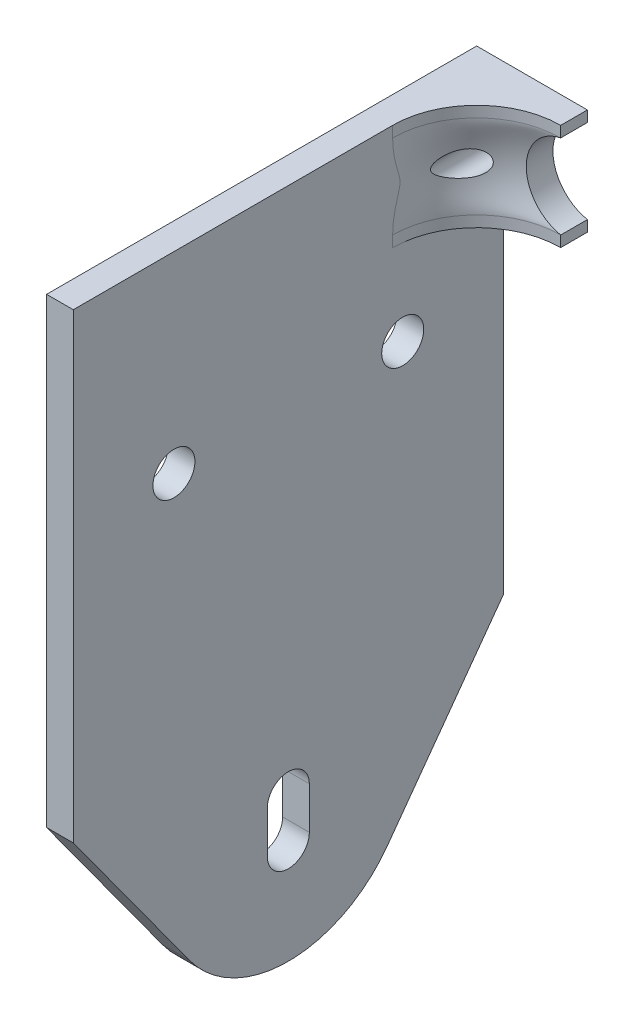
ISO-10303-21;
HEADER;
FILE_DESCRIPTION(('STEP AP214'),'2;1');
FILE_NAME('part.step','',(''),(''),'','','');
FILE_SCHEMA(('AUTOMOTIVE_DESIGN { 1 0 10303 214 1 1 1 1 }'));
ENDSEC;
DATA;
#1=APPLICATION_CONTEXT('core data for automotive mechanical design processes');
#2=APPLICATION_PROTOCOL_DEFINITION('international standard','automotive_design',2000,#1);
#3=PRODUCT_CONTEXT('',#1,'mechanical');
#4=PRODUCT('Part','Part','',(#3));
#5=PRODUCT_RELATED_PRODUCT_CATEGORY('part','',(#4));
#6=PRODUCT_DEFINITION_FORMATION('','',#4);
#7=PRODUCT_DEFINITION_CONTEXT('part definition',#1,'design');
#8=PRODUCT_DEFINITION('design','',#6,#7);
#9=PRODUCT_DEFINITION_SHAPE('','',#8);
#10=(LENGTH_UNIT() NAMED_UNIT(*) SI_UNIT(.MILLI.,.METRE.));
#11=(NAMED_UNIT(*) PLANE_ANGLE_UNIT() SI_UNIT($,.RADIAN.));
#12=(NAMED_UNIT(*) SI_UNIT($,.STERADIAN.) SOLID_ANGLE_UNIT());
#13=UNCERTAINTY_MEASURE_WITH_UNIT(LENGTH_MEASURE(1.E-05),#10,'distance_accuracy_value','');
#14=(GEOMETRIC_REPRESENTATION_CONTEXT(3) GLOBAL_UNCERTAINTY_ASSIGNED_CONTEXT((#13)) GLOBAL_UNIT_ASSIGNED_CONTEXT((#10,
#11,#12)) REPRESENTATION_CONTEXT('',''));
#15=CARTESIAN_POINT('',(0.,0.,0.));
#16=DIRECTION('',(0.,0.,1.));
#17=DIRECTION('',(1.,0.,0.));
#18=AXIS2_PLACEMENT_3D('',#15,#16,#17);
#19=CARTESIAN_POINT('',(-1.00000000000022,-59.1000000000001,25.5875000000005));
#20=DIRECTION('',(-1.,0.,0.));
#21=DIRECTION('',(0.,0.,1.));
#22=AXIS2_PLACEMENT_3D('',#19,#20,#21);
#23=CYLINDRICAL_SURFACE('',#22,14.5456403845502);
#24=DIRECTION('',(-1.,0.,0.));
#25=VECTOR('',#24,1.);
#26=CARTESIAN_POINT('',(-11.0000000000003,-67.65480133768,37.3514716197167));
#27=LINE('',#26,#25);
#28=CARTESIAN_POINT('',(-11.0000000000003,-67.65480133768,37.3514716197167));
#29=VERTEX_POINT('',#28);
#30=CARTESIAN_POINT('',(-14.1750000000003,-67.65480133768,37.3514716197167));
#31=VERTEX_POINT('',#30);
#32=EDGE_CURVE('E231',#29,#31,#27,.T.);
#33=ORIENTED_EDGE('',*,*,#32,.T.);
#34=CARTESIAN_POINT('',(-14.1750000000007,-59.1000000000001,25.5875000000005));
#35=DIRECTION('',(-1.,0.,0.));
#36=DIRECTION('',(0.,0.,1.));
#37=AXIS2_PLACEMENT_3D('',#34,#35,#36);
#38=CIRCLE('',#37,14.5456403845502);
#39=CARTESIAN_POINT('',(-14.1750000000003,-67.65480133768,13.8235283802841));
#40=VERTEX_POINT('',#39);
#41=EDGE_CURVE('E247',#40,#31,#38,.T.);
#42=ORIENTED_EDGE('',*,*,#41,.F.);
#43=DIRECTION('',(-1.,0.,0.));
#44=VECTOR('',#43,1.);
#45=CARTESIAN_POINT('',(-11.0000000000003,-67.65480133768,13.8235283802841));
#46=LINE('',#45,#44);
#47=CARTESIAN_POINT('',(-11.0000000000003,-67.65480133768,13.8235283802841));
#48=VERTEX_POINT('',#47);
#49=EDGE_CURVE('E242',#48,#40,#46,.T.);
#50=ORIENTED_EDGE('',*,*,#49,.F.);
#51=CARTESIAN_POINT('',(-11.0000000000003,-59.1000000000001,25.5875000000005));
#52=DIRECTION('',(1.,0.,0.));
#53=DIRECTION('',(0.,1.,0.));
#54=AXIS2_PLACEMENT_3D('',#51,#52,#53);
#55=CIRCLE('',#54,14.5456403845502);
#56=EDGE_CURVE('E323',#29,#48,#55,.T.);
#57=ORIENTED_EDGE('',*,*,#56,.F.);
#58=EDGE_LOOP('',(#33,#42,#50,#57));
#59=FACE_BOUND('',#58,.T.);
#60=ADVANCED_FACE('F75',(#59),#23,.T.);
#61=CARTESIAN_POINT('',(-14.1750000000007,0.,3.175));
#62=DIRECTION('',(1.,0.,0.));
#63=DIRECTION('',(0.,1.,0.));
#64=AXIS2_PLACEMENT_3D('',#61,#62,#63);
#65=PLANE('',#64);
#66=DIRECTION('',(0.,-0.80876271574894,0.588135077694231));
#67=VECTOR('',#66,1.);
#68=CARTESIAN_POINT('',(-14.1750000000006,-16.8266666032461,-23.1388691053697));
#69=LINE('',#68,#67);
#70=CARTESIAN_POINT('',(-14.1750000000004,-48.6456403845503,0.));
#71=VERTEX_POINT('',#70);
#72=EDGE_CURVE('E234',#71,#40,#69,.T.);
#73=ORIENTED_EDGE('',*,*,#72,.T.);
#74=ORIENTED_EDGE('',*,*,#41,.T.);
#75=DIRECTION('',(0.,-0.808762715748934,-0.588135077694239));
#76=VECTOR('',#75,1.);
#77=CARTESIAN_POINT('',(-14.1750000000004,-41.1686552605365,56.6122897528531));
#78=LINE('',#77,#76);
#79=CARTESIAN_POINT('',(-14.1750000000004,-48.6456403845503,51.175000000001));
#80=VERTEX_POINT('',#79);
#81=EDGE_CURVE('E225',#80,#31,#78,.T.);
#82=ORIENTED_EDGE('',*,*,#81,.F.);
#83=DIRECTION('',(0.,-1.,0.));
#84=VECTOR('',#83,1.);
#85=CARTESIAN_POINT('',(-14.1750000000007,0.,51.175));
#86=LINE('',#85,#84);
#87=CARTESIAN_POINT('',(-14.1750000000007,6.3,51.175));
#88=VERTEX_POINT('',#87);
#89=EDGE_CURVE('E210',#88,#80,#86,.T.);
#90=ORIENTED_EDGE('',*,*,#89,.F.);
#91=DIRECTION('',(0.,0.,-1.));
#92=VECTOR('',#91,1.);
#93=CARTESIAN_POINT('',(-14.1750000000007,6.3,3.175));
#94=LINE('',#93,#92);
#95=CARTESIAN_POINT('',(-14.1750000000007,6.3,0.));
#96=VERTEX_POINT('',#95);
#97=EDGE_CURVE('E224',#88,#96,#94,.T.);
#98=ORIENTED_EDGE('',*,*,#97,.T.);
#99=DIRECTION('',(0.,-1.,0.));
#100=VECTOR('',#99,1.);
#101=CARTESIAN_POINT('',(-14.1750000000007,0.,0.));
#102=LINE('',#101,#100);
#103=EDGE_CURVE('E301',#96,#71,#102,.T.);
#104=ORIENTED_EDGE('',*,*,#103,.T.);
#105=EDGE_LOOP('',(#73,#74,#82,#90,#98,#104));
#106=FACE_BOUND('',#105,.T.);
#107=CARTESIAN_POINT('',(-14.1750000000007,-16.5646205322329,39.1995513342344));
#108=DIRECTION('',(-1.,0.,0.));
#109=DIRECTION('',(0.,0.,1.));
#110=AXIS2_PLACEMENT_3D('',#107,#108,#109);
#111=CIRCLE('',#110,2.50000000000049);
#112=CARTESIAN_POINT('',(-14.1750000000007,-16.5646205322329,41.6995513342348));
#113=VERTEX_POINT('',#112);
#114=EDGE_CURVE('E252',#113,#113,#111,.T.);
#115=ORIENTED_EDGE('',*,*,#114,.F.);
#116=EDGE_LOOP('',(#115));
#117=FACE_BOUND('',#116,.T.);
#118=CARTESIAN_POINT('',(-14.1750000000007,-16.5646205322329,11.9754486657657));
#119=DIRECTION('',(-1.,0.,0.));
#120=DIRECTION('',(0.,0.,1.));
#121=AXIS2_PLACEMENT_3D('',#118,#119,#120);
#122=CIRCLE('',#121,2.50000000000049);
#123=CARTESIAN_POINT('',(-14.1750000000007,-16.5646205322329,14.4754486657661));
#124=VERTEX_POINT('',#123);
#125=EDGE_CURVE('E255',#124,#124,#122,.T.);
#126=ORIENTED_EDGE('',*,*,#125,.F.);
#127=EDGE_LOOP('',(#126));
#128=FACE_BOUND('',#127,.T.);
#129=DIRECTION('',(0.,-1.,0.));
#130=VECTOR('',#129,1.);
#131=CARTESIAN_POINT('',(-14.1750000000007,0.,28.0874999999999));
#132=LINE('',#131,#130);
#133=CARTESIAN_POINT('',(-14.1750000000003,-56.6000000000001,28.0875));
#134=VERTEX_POINT('',#133);
#135=CARTESIAN_POINT('',(-14.1750000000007,-61.6000000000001,28.0875));
#136=VERTEX_POINT('',#135);
#137=EDGE_CURVE('E250',#134,#136,#132,.T.);
#138=ORIENTED_EDGE('',*,*,#137,.T.);
#139=CARTESIAN_POINT('',(-14.1750000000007,-61.6000000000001,25.5875));
#140=DIRECTION('',(-1.,0.,0.));
#141=DIRECTION('',(0.,0.,1.));
#142=AXIS2_PLACEMENT_3D('',#139,#140,#141);
#143=CIRCLE('',#142,2.5);
#144=CARTESIAN_POINT('',(-14.1750000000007,-61.6000000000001,23.0875));
#145=VERTEX_POINT('',#144);
#146=EDGE_CURVE('E265',#145,#136,#143,.T.);
#147=ORIENTED_EDGE('',*,*,#146,.F.);
#148=DIRECTION('',(0.,-1.,0.));
#149=VECTOR('',#148,1.);
#150=CARTESIAN_POINT('',(-14.1750000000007,0.,23.0875));
#151=LINE('',#150,#149);
#152=CARTESIAN_POINT('',(-14.1750000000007,-56.6000000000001,23.0875));
#153=VERTEX_POINT('',#152);
#154=EDGE_CURVE('E262',#153,#145,#151,.T.);
#155=ORIENTED_EDGE('',*,*,#154,.F.);
#156=CARTESIAN_POINT('',(-14.1750000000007,-56.6000000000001,25.5875));
#157=DIRECTION('',(-1.,0.,0.));
#158=DIRECTION('',(0.,0.,1.));
#159=AXIS2_PLACEMENT_3D('',#156,#157,#158);
#160=CIRCLE('',#159,2.5);
#161=EDGE_CURVE('E259',#134,#153,#160,.T.);
#162=ORIENTED_EDGE('',*,*,#161,.F.);
#163=EDGE_LOOP('',(#138,#147,#155,#162));
#164=FACE_BOUND('',#163,.T.);
#165=ADVANCED_FACE('F356',(#106,#117,#128,#164),#65,.F.);
#166=CARTESIAN_POINT('',(-11.0000000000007,0.,3.175));
#167=DIRECTION('',(1.,0.,0.));
#168=DIRECTION('',(0.,1.,0.));
#169=AXIS2_PLACEMENT_3D('',#166,#167,#168);
#170=PLANE('',#169);
#171=DIRECTION('',(0.,-0.808762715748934,-0.588135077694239));
#172=VECTOR('',#171,1.);
#173=CARTESIAN_POINT('',(-11.0000000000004,-41.1686552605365,56.6122897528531));
#174=LINE('',#173,#172);
#175=CARTESIAN_POINT('',(-11.0000000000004,-48.6456403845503,51.175000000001));
#176=VERTEX_POINT('',#175);
#177=EDGE_CURVE('E227',#176,#29,#174,.T.);
#178=ORIENTED_EDGE('',*,*,#177,.T.);
#179=ORIENTED_EDGE('',*,*,#56,.T.);
#180=DIRECTION('',(0.,-0.80876271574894,0.588135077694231));
#181=VECTOR('',#180,1.);
#182=CARTESIAN_POINT('',(-11.0000000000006,-16.8266666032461,-23.1388691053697));
#183=LINE('',#182,#181);
#184=CARTESIAN_POINT('',(-11.0000000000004,-48.6456403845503,0.));
#185=VERTEX_POINT('',#184);
#186=EDGE_CURVE('E236',#185,#48,#183,.T.);
#187=ORIENTED_EDGE('',*,*,#186,.F.);
#188=DIRECTION('',(0.,-1.,0.));
#189=VECTOR('',#188,1.);
#190=CARTESIAN_POINT('',(-11.0000000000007,0.,0.));
#191=LINE('',#190,#189);
#192=CARTESIAN_POINT('',(-11.0000000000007,-6.31372699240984,0.));
#193=VERTEX_POINT('',#192);
#194=EDGE_CURVE('E303',#193,#185,#191,.T.);
#195=ORIENTED_EDGE('',*,*,#194,.F.);
#196=DIRECTION('',(0.,0.,-1.));
#197=VECTOR('',#196,1.);
#198=CARTESIAN_POINT('',(-11.0000000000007,-6.31372699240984,3.175));
#199=LINE('',#198,#197);
#200=CARTESIAN_POINT('',(-11.0000000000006,-6.31372699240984,13.175));
#201=VERTEX_POINT('',#200);
#202=EDGE_CURVE('E105',#201,#193,#199,.T.);
#203=ORIENTED_EDGE('',*,*,#202,.F.);
#204=DIRECTION('',(0.,-1.,0.));
#205=VECTOR('',#204,1.);
#206=CARTESIAN_POINT('',(-11.0000000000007,6.3,13.175));
#207=LINE('',#206,#205);
#208=CARTESIAN_POINT('',(-11.0000000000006,-5.00099990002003,13.175));
#209=VERTEX_POINT('',#208);
#210=EDGE_CURVE('E348',#201,#209,#207,.F.);
#211=ORIENTED_EDGE('',*,*,#210,.T.);
#212=CARTESIAN_POINT('',(-11.0000000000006,-7.27240041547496,12.9207002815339));
#213=CARTESIAN_POINT('',(-11.0000000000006,-4.98255912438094,2.86813965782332));
#214=CARTESIAN_POINT('',(-0.694744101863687,-5.05245788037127,3.175));
#215=CARTESIAN_POINT('',(-11.0000000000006,-7.1331111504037,12.952431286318));
#216=CARTESIAN_POINT('',(-11.0000000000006,-4.98816135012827,2.88068407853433));
#217=CARTESIAN_POINT('',(-0.707817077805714,-5.05065685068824,3.175));
#218=CARTESIAN_POINT('',(-11.0000000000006,-6.99314983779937,12.9812074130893));
#219=CARTESIAN_POINT('',(-11.0000000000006,-4.99324785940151,2.89420706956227));
#220=CARTESIAN_POINT('',(-0.721656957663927,-5.04870527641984,3.175));
#221=CARTESIAN_POINT('',(-11.0000000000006,-6.71213913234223,13.0328262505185));
#222=CARTESIAN_POINT('',(-11.0000000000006,-5.0020631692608,2.92347256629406));
#223=CARTESIAN_POINT('',(-0.751219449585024,-5.04439311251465,3.175));
#224=CARTESIAN_POINT('',(-11.0000000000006,-6.571089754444,13.055669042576));
#225=CARTESIAN_POINT('',(-11.0000000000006,-5.00579321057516,2.93920890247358));
#226=CARTESIAN_POINT('',(-0.76694203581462,-5.04203252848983,3.175));
#227=CARTESIAN_POINT('',(-11.0000000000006,-6.28814529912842,13.0953997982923));
#228=CARTESIAN_POINT('',(-11.0000000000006,-5.01158229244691,2.97316385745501));
#229=CARTESIAN_POINT('',(-0.800620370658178,-5.03679419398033,3.175));
#230=CARTESIAN_POINT('',(-11.0000000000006,-6.14625016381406,13.1122873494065));
#231=CARTESIAN_POINT('',(-11.0000000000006,-5.01364344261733,2.99137459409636));
#232=CARTESIAN_POINT('',(-0.818576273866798,-5.03391640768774,3.175));
#233=CARTESIAN_POINT('',(-11.0000000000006,-5.86187806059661,13.1401026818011));
#234=CARTESIAN_POINT('',(-11.0000000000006,-5.01567670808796,3.03061763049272));
#235=CARTESIAN_POINT('',(-0.857188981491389,-5.02748562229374,3.175));
#236=CARTESIAN_POINT('',(-11.0000000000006,-5.71940109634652,13.1510305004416));
#237=CARTESIAN_POINT('',(-11.0000000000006,-5.01565265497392,3.05163912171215));
#238=CARTESIAN_POINT('',(-0.877845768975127,-5.02393262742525,3.175));
#239=CARTESIAN_POINT('',(-11.0000000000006,-5.43727081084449,13.1667654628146));
#240=CARTESIAN_POINT('',(-11.0000000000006,-5.01301376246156,3.09642408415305));
#241=CARTESIAN_POINT('',(-0.921965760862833,-5.01602148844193,3.175));
#242=CARTESIAN_POINT('',(-11.0000000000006,-5.29762471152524,13.1717025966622));
#243=CARTESIAN_POINT('',(-11.0000000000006,-5.01046225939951,3.1201017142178));
#244=CARTESIAN_POINT('',(-0.945356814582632,-5.01168288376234,3.175));
#245=CARTESIAN_POINT('',(-11.0000000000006,-5.01824711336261,13.1759262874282));
#246=CARTESIAN_POINT('',(-11.0000000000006,-5.002201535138,3.17105372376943));
#247=CARTESIAN_POINT('',(-0.996028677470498,-5.0018590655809,3.175));
#248=CARTESIAN_POINT('',(-11.0000000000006,-4.87851561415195,13.175212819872));
#249=CARTESIAN_POINT('',(-11.0000000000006,-4.99650187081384,3.1983093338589));
#250=CARTESIAN_POINT('',(-1.02330950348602,-4.99637384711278,3.175));
#251=CARTESIAN_POINT('',(-11.0000000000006,-4.59925056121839,13.1681937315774));
#252=CARTESIAN_POINT('',(-11.0000000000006,-4.98108437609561,3.25703645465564));
#253=CARTESIAN_POINT('',(-1.08271693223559,-4.98383920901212,3.175));
#254=CARTESIAN_POINT('',(-11.0000000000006,-4.45971694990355,13.1618903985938));
#255=CARTESIAN_POINT('',(-11.0000000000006,-4.97138364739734,3.28847999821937));
#256=CARTESIAN_POINT('',(-1.11484154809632,-4.97679043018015,3.175));
#257=CARTESIAN_POINT('',(-11.0000000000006,-4.18101909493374,13.1437833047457));
#258=CARTESIAN_POINT('',(-11.0000000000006,-4.94677218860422,3.35641085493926));
#259=CARTESIAN_POINT('',(-1.18525885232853,-4.96048978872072,3.175));
#260=CARTESIAN_POINT('',(-11.0000000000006,-4.04185483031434,13.1319798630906));
#261=CARTESIAN_POINT('',(-11.0000000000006,-4.93188700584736,3.39286046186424));
#262=CARTESIAN_POINT('',(-1.22355118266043,-4.95123805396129,3.175));
#263=CARTESIAN_POINT('',(-11.0000000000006,-3.73671890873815,13.1001384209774));
#264=CARTESIAN_POINT('',(-11.0000000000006,-4.89171026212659,3.47960043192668));
#265=CARTESIAN_POINT('',(-1.31639510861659,-4.92746495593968,3.175));
#266=CARTESIAN_POINT('',(-11.0000000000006,-3.57086687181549,13.0789363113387));
#267=CARTESIAN_POINT('',(-11.0000000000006,-4.86499262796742,3.53115903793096));
#268=CARTESIAN_POINT('',(-1.37266368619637,-4.91226453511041,3.175));
#269=CARTESIAN_POINT('',(-11.0000000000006,-3.32291857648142,13.0415961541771));
#270=CARTESIAN_POINT('',(-11.0000000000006,-4.81426274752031,3.61708553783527));
#271=CARTESIAN_POINT('',(-1.46899168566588,-4.88396858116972,3.175));
#272=CARTESIAN_POINT('',(-11.0000000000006,-3.24039404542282,13.0282239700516));
#273=CARTESIAN_POINT('',(-11.0000000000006,-4.7956373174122,3.6470703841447));
#274=CARTESIAN_POINT('',(-1.50309507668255,-4.87361857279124,3.175));
#275=CARTESIAN_POINT('',(-11.0000000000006,-3.07565484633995,12.9996918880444));
#276=CARTESIAN_POINT('',(-11.0000000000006,-4.75408002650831,3.71026079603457));
#277=CARTESIAN_POINT('',(-1.57608536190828,-4.85050852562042,3.175));
#278=CARTESIAN_POINT('',(-11.0000000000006,-2.99344017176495,12.9845320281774));
#279=CARTESIAN_POINT('',(-11.0000000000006,-4.73117214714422,3.74344144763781));
#280=CARTESIAN_POINT('',(-1.61497215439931,-4.83774853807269,3.175));
#281=CARTESIAN_POINT('',(-11.0000000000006,-2.82812820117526,12.9522577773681));
#282=CARTESIAN_POINT('',(-11.0000000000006,-4.67969934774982,3.81401356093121));
#283=CARTESIAN_POINT('',(-1.69911616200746,-4.8088477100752,3.175));
#284=CARTESIAN_POINT('',(-11.0000000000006,-2.74503593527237,12.935117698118));
#285=CARTESIAN_POINT('',(-11.0000000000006,-4.65108896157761,3.85142866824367));
#286=CARTESIAN_POINT('',(-1.74445942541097,-4.79265946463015,3.175));
#287=CARTESIAN_POINT('',(-11.0000000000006,-2.57921456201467,12.899166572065));
#288=CARTESIAN_POINT('',(-11.0000000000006,-4.58708233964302,3.93065183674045));
#289=CARTESIAN_POINT('',(-1.84235447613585,-4.75588838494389,3.175));
#290=CARTESIAN_POINT('',(-11.0000000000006,-2.49648545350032,12.8803555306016));
#291=CARTESIAN_POINT('',(-11.0000000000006,-4.55173706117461,3.97241492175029));
#292=CARTESIAN_POINT('',(-1.89490624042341,-4.73530556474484,3.175));
#293=CARTESIAN_POINT('',(-11.0000000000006,-2.33150494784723,12.8412168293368));
#294=CARTESIAN_POINT('',(-11.0000000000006,-4.47251906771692,4.06095970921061));
#295=CARTESIAN_POINT('',(-2.00876614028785,-4.68814082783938,3.175));
#296=CARTESIAN_POINT('',(-11.0000000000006,-2.24925305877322,12.8208912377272));
#297=CARTESIAN_POINT('',(-11.0000000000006,-4.42873249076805,4.1076744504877));
#298=CARTESIAN_POINT('',(-2.07006243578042,-4.66156699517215,3.175));
#299=CARTESIAN_POINT('',(-11.0000000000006,-2.08510004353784,12.7788738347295));
#300=CARTESIAN_POINT('',(-11.0000000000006,-4.3301877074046,4.2069395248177));
#301=CARTESIAN_POINT('',(-2.20350186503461,-4.60000134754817,3.175));
#302=CARTESIAN_POINT('',(-11.0000000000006,-2.00319891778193,12.7571820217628));
#303=CARTESIAN_POINT('',(-11.0000000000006,-4.27553991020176,4.25940969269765));
#304=CARTESIAN_POINT('',(-2.27564501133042,-4.56500952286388,3.175));
#305=CARTESIAN_POINT('',(-11.0000000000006,-1.8391142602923,12.7125122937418));
#306=CARTESIAN_POINT('',(-11.0000000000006,-4.1515182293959,4.37139530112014));
#307=CARTESIAN_POINT('',(-2.43385425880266,-4.48267622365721,3.175));
#308=CARTESIAN_POINT('',(-11.0000000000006,-1.75693295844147,12.6895262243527));
#309=CARTESIAN_POINT('',(-11.0000000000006,-4.08220701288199,4.43085273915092));
#310=CARTESIAN_POINT('',(-2.52001711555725,-4.43524741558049,3.175));
#311=CARTESIAN_POINT('',(-11.0000000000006,-1.59279805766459,12.6427622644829));
#312=CARTESIAN_POINT('',(-11.0000000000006,-3.92444920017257,4.55726071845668));
#313=CARTESIAN_POINT('',(-2.70891356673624,-4.32250822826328,3.175));
#314=CARTESIAN_POINT('',(-11.0000000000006,-1.51084445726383,12.6189843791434));
#315=CARTESIAN_POINT('',(-11.0000000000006,-3.8362610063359,4.62406747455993));
#316=CARTESIAN_POINT('',(-2.81164705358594,-4.25719796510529,3.175));
#317=CARTESIAN_POINT('',(-11.0000000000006,-1.38777745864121,12.5830663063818));
#318=CARTESIAN_POINT('',(-11.0000000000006,-3.68411269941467,4.73051591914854));
#319=CARTESIAN_POINT('',(-2.98069276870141,-4.13885457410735,3.175));
#320=CARTESIAN_POINT('',(-11.0000000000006,-1.34663546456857,12.5710231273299));
#321=CARTESIAN_POINT('',(-11.0000000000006,-3.63018772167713,4.76697270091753));
#322=CARTESIAN_POINT('',(-3.03968870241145,-4.09588523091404,3.175));
#323=CARTESIAN_POINT('',(-11.0000000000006,-1.26434289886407,12.5469661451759));
#324=CARTESIAN_POINT('',(-11.0000000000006,-3.51483712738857,4.84174661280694));
#325=CARTESIAN_POINT('',(-3.16289418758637,-4.00151963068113,3.175));
#326=CARTESIAN_POINT('',(-11.0000000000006,-1.22319232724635,12.5349523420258));
#327=CARTESIAN_POINT('',(-11.0000000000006,-3.4534720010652,4.88003973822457));
#328=CARTESIAN_POINT('',(-3.22710373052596,-3.95012338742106,3.175));
#329=CARTESIAN_POINT('',(-11.0000000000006,-1.14084611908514,12.5110666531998));
#330=CARTESIAN_POINT('',(-11.0000000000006,-3.32207038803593,4.95830654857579));
#331=CARTESIAN_POINT('',(-3.36085401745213,-3.83696931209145,3.175));
#332=CARTESIAN_POINT('',(-11.0000000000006,-1.09965047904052,12.4991947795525));
#333=CARTESIAN_POINT('',(-11.0000000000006,-3.25210544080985,4.9982561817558));
#334=CARTESIAN_POINT('',(-3.43039520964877,-3.77521060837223,3.175));
#335=CARTESIAN_POINT('',(-11.0000000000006,-1.01717726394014,12.4757373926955));
#336=CARTESIAN_POINT('',(-11.0000000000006,-3.10219115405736,5.07947093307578));
#337=CARTESIAN_POINT('',(-3.57459718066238,-3.63897050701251,3.175));
#338=CARTESIAN_POINT('',(-11.0000000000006,-0.975899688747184,12.4641518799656));
#339=CARTESIAN_POINT('',(-11.0000000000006,-3.02232583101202,5.12071399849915));
#340=CARTESIAN_POINT('',(-3.64925796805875,-3.564489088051,3.175));
#341=CARTESIAN_POINT('',(-11.0000000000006,-0.894436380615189,12.441781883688));
#342=CARTESIAN_POINT('',(-11.0000000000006,-2.85371771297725,5.20267649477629));
#343=CARTESIAN_POINT('',(-3.80068388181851,-3.40245984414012,3.175));
#344=CARTESIAN_POINT('',(-11.0000000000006,-0.854254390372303,12.4309838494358));
#345=CARTESIAN_POINT('',(-11.0000000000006,-2.76540739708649,5.24335339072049));
#346=CARTESIAN_POINT('',(-3.87732181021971,-3.31536268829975,3.175));
#347=CARTESIAN_POINT('',(-11.0000000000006,-0.773721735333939,12.410030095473));
#348=CARTESIAN_POINT('',(-11.0000000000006,-2.5767955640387,5.32448177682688));
#349=CARTESIAN_POINT('',(-4.03327672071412,-3.123770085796,3.175));
#350=CARTESIAN_POINT('',(-11.0000000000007,-0.733371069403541,12.3998743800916));
#351=CARTESIAN_POINT('',(-11.0000000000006,-2.47657994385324,5.36492849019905));
#352=CARTESIAN_POINT('',(-4.11259372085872,-3.01927452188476,3.175));
#353=CARTESIAN_POINT('',(-11.0000000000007,-0.652444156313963,12.3804508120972));
#354=CARTESIAN_POINT('',(-11.0000000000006,-2.2630656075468,5.44432603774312));
#355=CARTESIAN_POINT('',(-4.27141202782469,-2.79006688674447,3.175));
#356=CARTESIAN_POINT('',(-11.0000000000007,-0.611867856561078,12.3711831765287));
#357=CARTESIAN_POINT('',(-11.0000000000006,-2.14983719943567,5.48328725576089));
#358=CARTESIAN_POINT('',(-4.35091337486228,-2.66534989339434,3.175));
#359=CARTESIAN_POINT('',(-11.0000000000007,-0.530459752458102,12.3538317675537));
#360=CARTESIAN_POINT('',(-11.0000000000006,-1.90974879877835,5.55796316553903));
#361=CARTESIAN_POINT('',(-4.50617668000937,-2.39349935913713,3.175));
#362=CARTESIAN_POINT('',(-11.0000000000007,-0.489627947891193,12.3457479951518));
#363=CARTESIAN_POINT('',(-11.0000000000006,-1.78292781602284,5.59370875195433));
#364=CARTESIAN_POINT('',(-4.5819386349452,-2.24636579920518,3.175));
#365=CARTESIAN_POINT('',(-11.0000000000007,-0.40810463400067,12.3311668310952));
#366=CARTESIAN_POINT('',(-11.0000000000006,-1.51735928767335,5.65944998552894));
#367=CARTESIAN_POINT('',(-4.72360465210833,-1.93057908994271,3.175));
#368=CARTESIAN_POINT('',(-11.0000000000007,-0.367415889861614,12.3246542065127));
#369=CARTESIAN_POINT('',(-11.0000000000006,-1.37872754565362,5.68954866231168));
#370=CARTESIAN_POINT('',(-4.78960075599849,-1.76215890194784,3.175));
#371=CARTESIAN_POINT('',(-11.0000000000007,-0.285787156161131,12.3134358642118));
#372=CARTESIAN_POINT('',(-11.0000000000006,-1.09016102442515,5.74211339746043));
#373=CARTESIAN_POINT('',(-4.90637200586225,-1.40456056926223,3.175));
#374=CARTESIAN_POINT('',(-11.0000000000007,-0.244847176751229,12.3087300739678));
#375=CARTESIAN_POINT('',(-11.0000000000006,-0.940112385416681,5.76464128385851));
#376=CARTESIAN_POINT('',(-4.95714776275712,-1.2153832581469,3.175));
#377=CARTESIAN_POINT('',(-11.0000000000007,-0.162823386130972,12.3014116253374));
#378=CARTESIAN_POINT('',(-11.0000000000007,-0.632198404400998,5.79992133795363));
#379=CARTESIAN_POINT('',(-5.03733576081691,-0.821845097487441,3.175));
#380=CARTESIAN_POINT('',(-11.0000000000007,-0.121739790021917,12.2987966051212));
#381=CARTESIAN_POINT('',(-11.0000000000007,-0.474130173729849,5.8127392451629));
#382=CARTESIAN_POINT('',(-5.06677210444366,-0.617501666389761,3.175));
#383=CARTESIAN_POINT('',(-11.0000000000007,-0.039490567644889,12.2958290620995));
#384=CARTESIAN_POINT('',(-11.0000000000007,-0.154776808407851,5.82727501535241));
#385=CARTESIAN_POINT('',(-5.10024465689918,-0.202114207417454,3.175));
#386=CARTESIAN_POINT('',(-11.0000000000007,0.00167505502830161,12.2954764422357));
#387=CARTESIAN_POINT('',(-11.0000000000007,0.00679224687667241,5.82901963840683));
#388=CARTESIAN_POINT('',(-5.10428195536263,0.00892953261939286,3.175));
#389=CARTESIAN_POINT('',(-11.0000000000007,0.0811703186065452,12.2970040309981));
#390=CARTESIAN_POINT('',(-11.0000000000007,0.316864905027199,5.82152254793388));
#391=CARTESIAN_POINT('',(-5.08698775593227,0.413221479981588,3.175));
#392=CARTESIAN_POINT('',(-11.0000000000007,0.119502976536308,12.2987344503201));
#393=CARTESIAN_POINT('',(-11.0000000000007,0.465765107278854,5.81300594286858));
#394=CARTESIAN_POINT('',(-5.06735798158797,0.606705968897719,3.175));
#395=CARTESIAN_POINT('',(-11.0000000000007,0.196035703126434,12.3040761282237));
#396=CARTESIAN_POINT('',(-11.0000000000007,0.757672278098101,5.78705906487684));
#397=CARTESIAN_POINT('',(-5.00801882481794,0.982879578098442,3.175));
#398=CARTESIAN_POINT('',(-11.0000000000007,0.234235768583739,12.3076874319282));
#399=CARTESIAN_POINT('',(-11.0000000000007,0.900876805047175,5.76959100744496));
#400=CARTESIAN_POINT('',(-4.96830896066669,1.16556843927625,3.175));
#401=CARTESIAN_POINT('',(-11.0000000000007,0.310477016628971,12.3165964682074));
#402=CARTESIAN_POINT('',(-11.0000000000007,1.17848461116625,5.72725835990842));
#403=CARTESIAN_POINT('',(-4.87320798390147,1.51483161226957,3.175));
#404=CARTESIAN_POINT('',(-11.0000000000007,0.348517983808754,12.3218960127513));
#405=CARTESIAN_POINT('',(-11.0000000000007,1.31300619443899,5.70233628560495));
#406=CARTESIAN_POINT('',(-4.8178000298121,1.68138835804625,3.175));
#407=CARTESIAN_POINT('',(-11.0000000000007,0.42437014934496,12.3339280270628));
#408=CARTESIAN_POINT('',(-11.0000000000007,1.57124605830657,5.646950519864));
#409=CARTESIAN_POINT('',(-4.69648366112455,1.99535012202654,3.175));
#410=CARTESIAN_POINT('',(-11.0000000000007,0.462181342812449,12.3406605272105));
#411=CARTESIAN_POINT('',(-11.0000000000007,1.6950190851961,5.61644010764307));
#412=CARTESIAN_POINT('',(-4.63057502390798,2.14275473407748,3.175));
#413=CARTESIAN_POINT('',(-11.0000000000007,0.537943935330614,12.3553657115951));
#414=CARTESIAN_POINT('',(-11.0000000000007,1.93220471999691,5.55136340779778));
#415=CARTESIAN_POINT('',(-4.49235380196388,2.41928128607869,3.175));
#416=CARTESIAN_POINT('',(-11.0000000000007,0.575893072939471,12.3633499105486));
#417=CARTESIAN_POINT('',(-11.0000000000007,2.04549379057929,5.51672698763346));
#418=CARTESIAN_POINT('',(-4.41998475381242,2.54820975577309,3.175));
#419=CARTESIAN_POINT('',(-11.0000000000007,0.651580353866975,12.3802533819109));
#420=CARTESIAN_POINT('',(-11.0000000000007,2.26044009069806,5.44524317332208));
#421=CARTESIAN_POINT('',(-4.27331817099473,2.78718940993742,3.175));
#422=CARTESIAN_POINT('',(-11.0000000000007,0.689318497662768,12.3891726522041));
#423=CARTESIAN_POINT('',(-11.0000000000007,2.36205366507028,5.40837672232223));
#424=CARTESIAN_POINT('',(-4.19902064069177,2.89724063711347,3.175));
#425=CARTESIAN_POINT('',(-11.0000000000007,0.76460523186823,12.4077169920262));
#426=CARTESIAN_POINT('',(-11.0000000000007,2.55427240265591,5.33370531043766));
#427=CARTESIAN_POINT('',(-4.05130722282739,3.10043309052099,3.175));
#428=CARTESIAN_POINT('',(-11.0000000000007,0.802153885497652,12.4173418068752));
#429=CARTESIAN_POINT('',(-11.0000000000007,2.64481799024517,5.29589587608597));
#430=CARTESIAN_POINT('',(-3.97789102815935,3.19358037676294,3.175));
#431=CARTESIAN_POINT('',(-11.0000000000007,0.87711376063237,12.4371087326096));
#432=CARTESIAN_POINT('',(-11.0000000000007,2.81587454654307,5.22025366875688));
#433=CARTESIAN_POINT('',(-3.83370715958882,3.36530167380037,3.175));
#434=CARTESIAN_POINT('',(-11.0000000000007,0.914524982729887,12.4472508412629));
#435=CARTESIAN_POINT('',(-11.0000000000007,2.89631560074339,5.18242677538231));
#436=CARTESIAN_POINT('',(-3.76293947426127,3.44387574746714,3.175));
#437=CARTESIAN_POINT('',(-11.0000000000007,0.990446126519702,12.4682247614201));
#438=CARTESIAN_POINT('',(-11.0000000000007,3.05064274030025,5.10618872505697));
#439=CARTESIAN_POINT('',(-3.62288126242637,3.5910131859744,3.175));
#440=CARTESIAN_POINT('',(-11.0000000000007,1.02895280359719,12.47906826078));
#441=CARTESIAN_POINT('',(-11.0000000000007,3.12414845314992,5.06781833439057));
#442=CARTESIAN_POINT('',(-3.55371090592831,3.65917466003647,3.175));
#443=CARTESIAN_POINT('',(-11.0000000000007,1.10589753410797,12.5009948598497));
#444=CARTESIAN_POINT('',(-11.0000000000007,3.26269209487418,4.99221235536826));
#445=CARTESIAN_POINT('',(-3.41984893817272,3.78457863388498,3.175));
#446=CARTESIAN_POINT('',(-11.0000000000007,1.14433558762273,12.5120779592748));
#447=CARTESIAN_POINT('',(-11.0000000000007,3.32766243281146,4.95499487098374));
#448=CARTESIAN_POINT('',(-3.35515732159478,3.84182114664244,3.175));
#449=CARTESIAN_POINT('',(-11.0000000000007,1.2211751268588,12.5343681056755));
#450=CARTESIAN_POINT('',(-11.0000000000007,3.45018178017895,4.88197990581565));
#451=CARTESIAN_POINT('',(-3.23040968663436,3.94729351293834,3.175));
#452=CARTESIAN_POINT('',(-11.0000000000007,1.25957661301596,12.5455751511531));
#453=CARTESIAN_POINT('',(-11.0000000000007,3.50767220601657,4.84620206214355));
#454=CARTESIAN_POINT('',(-3.17035361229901,3.99552347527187,3.175));
#455=CARTESIAN_POINT('',(-11.0000000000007,1.33637047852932,12.5680204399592));
#456=CARTESIAN_POINT('',(-11.0000000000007,3.61616463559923,4.77621838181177));
#457=CARTESIAN_POINT('',(-3.05479083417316,4.08454933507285,3.175));
#458=CARTESIAN_POINT('',(-11.0000000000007,1.37476285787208,12.5792586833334));
#459=CARTESIAN_POINT('',(-11.0000000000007,3.66711691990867,4.7420320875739));
#460=CARTESIAN_POINT('',(-2.99928413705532,4.1253452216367,3.175));
#461=CARTESIAN_POINT('',(-11.0000000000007,1.48961803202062,12.6128021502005));
#462=CARTESIAN_POINT('',(-11.0000000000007,3.81141726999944,4.64201582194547));
#463=CARTESIAN_POINT('',(-2.83974671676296,4.23827212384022,3.175));
#464=CARTESIAN_POINT('',(-11.0000000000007,1.5661015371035,12.6350371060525));
#465=CARTESIAN_POINT('',(-11.0000000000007,3.89585688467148,4.57895346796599));
#466=CARTESIAN_POINT('',(-2.7421450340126,4.30138794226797,3.175));
#467=CARTESIAN_POINT('',(-11.0000000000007,1.71925466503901,12.6788691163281));
#468=CARTESIAN_POINT('',(-11.0000000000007,4.04786331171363,4.45916864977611));
#469=CARTESIAN_POINT('',(-2.56173557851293,4.41118059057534,3.175));
#470=CARTESIAN_POINT('',(-11.0000000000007,1.79592429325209,12.7004661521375));
#471=CARTESIAN_POINT('',(-11.0000000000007,4.11520752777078,4.40256713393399));
#472=CARTESIAN_POINT('',(-2.47892823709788,4.45785694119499,3.175));
#473=CARTESIAN_POINT('',(-11.0000000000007,1.94819229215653,12.7423521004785));
#474=CARTESIAN_POINT('',(-11.0000000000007,4.23580118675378,4.29612066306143));
#475=CARTESIAN_POINT('',(-2.32694121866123,4.53901039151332,3.175));
#476=CARTESIAN_POINT('',(-11.0000000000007,2.02378619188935,12.7626572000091));
#477=CARTESIAN_POINT('',(-11.0000000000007,4.28913788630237,4.24625954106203));
#478=CARTESIAN_POINT('',(-2.25755017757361,4.57368495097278,3.175));
#479=CARTESIAN_POINT('',(-11.0000000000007,2.17526588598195,12.8021517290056));
#480=CARTESIAN_POINT('',(-11.0000000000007,4.38594750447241,4.15156723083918));
#481=CARTESIAN_POINT('',(-2.12857927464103,4.63510804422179,3.175));
#482=CARTESIAN_POINT('',(-11.0000000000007,2.2511516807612,12.8213411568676));
#483=CARTESIAN_POINT('',(-11.0000000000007,4.42932298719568,4.10680458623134));
#484=CARTESIAN_POINT('',(-2.06899942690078,4.66185656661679,3.175));
#485=CARTESIAN_POINT('',(-11.0000000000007,2.40323271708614,12.8584536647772));
#486=CARTESIAN_POINT('',(-11.0000000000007,4.50824804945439,4.02171821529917));
#487=CARTESIAN_POINT('',(-1.95792951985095,4.70958106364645,3.175));
#488=CARTESIAN_POINT('',(-11.0000000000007,2.47942795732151,12.8763767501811));
#489=CARTESIAN_POINT('',(-11.0000000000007,4.54373037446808,3.98144675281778));
#490=CARTESIAN_POINT('',(-1.9064394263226,4.73055706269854,3.175));
#491=CARTESIAN_POINT('',(-11.0000000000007,2.63213103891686,12.9108439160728));
#492=CARTESIAN_POINT('',(-11.0000000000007,4.60841085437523,3.90480111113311));
#493=CARTESIAN_POINT('',(-1.81015149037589,4.76822980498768,3.175));
#494=CARTESIAN_POINT('',(-11.0000000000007,2.70863888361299,12.927387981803));
#495=CARTESIAN_POINT('',(-11.0000000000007,4.637561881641,3.86846693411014));
#496=CARTESIAN_POINT('',(-1.76535371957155,4.78492650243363,3.175));
#497=CARTESIAN_POINT('',(-11.0000000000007,2.86207298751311,12.9590340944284));
#498=CARTESIAN_POINT('',(-11.0000000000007,4.69080128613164,3.79916455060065));
#499=CARTESIAN_POINT('',(-1.68125951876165,4.81511814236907,3.175));
#500=CARTESIAN_POINT('',(-11.0000000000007,2.9389997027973,12.9741339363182));
#501=CARTESIAN_POINT('',(-11.0000000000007,4.71484838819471,3.76623249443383));
#502=CARTESIAN_POINT('',(-1.6419714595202,4.82860823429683,3.175));
#503=CARTESIAN_POINT('',(-11.0000000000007,3.09313930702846,13.0027961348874));
#504=CARTESIAN_POINT('',(-11.0000000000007,4.75873348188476,3.7033844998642));
#505=CARTESIAN_POINT('',(-1.5680724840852,4.85310741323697,3.175));
#506=CARTESIAN_POINT('',(-11.0000000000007,3.17035220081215,13.0163584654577));
#507=CARTESIAN_POINT('',(-11.0000000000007,4.77854737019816,3.67349249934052));
#508=CARTESIAN_POINT('',(-1.53346164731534,4.86411645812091,3.175));
#509=CARTESIAN_POINT('',(-11.0000000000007,3.40238830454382,13.0546558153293));
#510=CARTESIAN_POINT('',(-11.0000000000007,4.83288436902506,3.58764939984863));
#511=CARTESIAN_POINT('',(-1.43550393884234,4.89428906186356,3.175));
#512=CARTESIAN_POINT('',(-11.0000000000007,3.5576143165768,13.0770023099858));
#513=CARTESIAN_POINT('',(-11.0000000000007,4.86203340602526,3.53590580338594));
#514=CARTESIAN_POINT('',(-1.37802903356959,4.91059906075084,3.175));
#515=CARTESIAN_POINT('',(-11.0000000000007,3.86666323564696,13.1147368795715));
#516=CARTESIAN_POINT('',(-11.0000000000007,4.91030391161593,3.44135647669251));
#517=CARTESIAN_POINT('',(-1.27512999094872,4.93829680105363,3.175));
#518=CARTESIAN_POINT('',(-11.0000000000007,4.02047461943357,13.13021956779));
#519=CARTESIAN_POINT('',(-11.0000000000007,4.92949196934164,3.39851963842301));
#520=CARTESIAN_POINT('',(-1.22954581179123,4.94975136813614,3.175));
#521=CARTESIAN_POINT('',(-11.0000000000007,4.3286254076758,13.1544929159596));
#522=CARTESIAN_POINT('',(-11.0000000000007,4.96095393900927,3.31932304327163));
#523=CARTESIAN_POINT('',(-1.14660724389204,4.96961840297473,3.175));
#524=CARTESIAN_POINT('',(-11.0000000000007,4.48296480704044,13.1632836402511));
#525=CARTESIAN_POINT('',(-11.0000000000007,4.97318729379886,3.28302083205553));
#526=CARTESIAN_POINT('',(-1.10925277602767,4.97803089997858,3.175));
#527=CARTESIAN_POINT('',(-11.0000000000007,4.79184952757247,13.1740388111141));
#528=CARTESIAN_POINT('',(-11.0000000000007,4.99247581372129,3.21573651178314));
#529=CARTESIAN_POINT('',(-1.04083109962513,4.99278347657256,3.175));
#530=CARTESIAN_POINT('',(-11.0000000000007,4.94639479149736,13.1760048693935));
#531=CARTESIAN_POINT('',(-11.0000000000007,4.99950872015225,3.18479166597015));
#532=CARTESIAN_POINT('',(-1.00976240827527,4.99912404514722,3.175));
#533=CARTESIAN_POINT('',(-11.0000000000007,5.2554233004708,13.1730345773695));
#534=CARTESIAN_POINT('',(-11.0000000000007,5.0096086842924,3.12734724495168));
#535=CARTESIAN_POINT('',(-0.952528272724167,5.01034223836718,3.175));
#536=CARTESIAN_POINT('',(-11.0000000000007,5.40990653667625,13.1680974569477));
#537=CARTESIAN_POINT('',(-11.0000000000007,5.01266146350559,3.10087477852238));
#538=CARTESIAN_POINT('',(-0.926363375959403,5.01521969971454,3.175));
#539=CARTESIAN_POINT('',(-11.0000000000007,5.88852350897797,13.1419824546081));
#540=CARTESIAN_POINT('',(-11.0000000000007,5.01743416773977,3.02446153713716));
#541=CARTESIAN_POINT('',(-0.85116253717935,5.02874377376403,3.175));
#542=CARTESIAN_POINT('',(-11.0000000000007,6.21209948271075,13.1089058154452));
#543=CARTESIAN_POINT('',(-11.0000000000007,5.01391590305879,2.98112905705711));
#544=CARTESIAN_POINT('',(-0.808678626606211,5.0356245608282,3.175));
#545=CARTESIAN_POINT('',(-11.0000000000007,6.85457462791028,13.011945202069));
#546=CARTESIAN_POINT('',(-11.0000000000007,4.99889159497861,2.90666130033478));
#547=CARTESIAN_POINT('',(-0.734572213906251,5.04695332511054,3.175));
#548=CARTESIAN_POINT('',(-11.0000000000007,7.1734732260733,12.9480574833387));
#549=CARTESIAN_POINT('',(-11.0000000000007,4.98736241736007,2.87561478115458));
#550=CARTESIAN_POINT('',(-0.702951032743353,5.05140100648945,3.175));
#551=CARTESIAN_POINT('',(-11.0000000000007,7.80896141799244,12.7885231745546));
#552=CARTESIAN_POINT('',(-11.0000000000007,4.95915306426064,2.8226886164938));
#553=CARTESIAN_POINT('',(-0.646671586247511,5.05891644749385,3.175));
#554=CARTESIAN_POINT('',(-11.0000000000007,8.1254242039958,12.6923656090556));
#555=CARTESIAN_POINT('',(-11.0000000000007,4.94238726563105,2.80102111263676));
#556=CARTESIAN_POINT('',(-0.622137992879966,5.06196000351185,3.175));
#557=CARTESIAN_POINT('',(-11.0000000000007,8.59180406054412,12.5251888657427));
#558=CARTESIAN_POINT('',(-11.0000000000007,4.91504812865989,2.77460161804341));
#559=CARTESIAN_POINT('',(-0.589417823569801,5.06583666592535,3.175));
#560=CARTESIAN_POINT('',(-11.0000000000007,8.74591578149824,12.4656221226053));
#561=CARTESIAN_POINT('',(-11.0000000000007,4.90556022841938,2.7668054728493));
#562=CARTESIAN_POINT('',(-0.57918909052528,5.06701431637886,3.175));
#563=CARTESIAN_POINT('',(-11.0000000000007,9.05101938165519,12.3389684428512));
#564=CARTESIAN_POINT('',(-11.0000000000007,4.8860339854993,2.75307216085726));
#565=CARTESIAN_POINT('',(-0.55990543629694,5.06918140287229,3.175));
#566=CARTESIAN_POINT('',(-11.0000000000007,9.20201122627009,12.2718814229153));
#567=CARTESIAN_POINT('',(-11.0000000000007,4.87599626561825,2.74713772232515));
#568=CARTESIAN_POINT('',(-0.550850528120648,5.07017083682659,3.175));
#569=CARTESIAN_POINT('',(-11.0000000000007,9.35128158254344,12.201097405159));
#570=CARTESIAN_POINT('',(-11.0000000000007,4.86578022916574,2.74204787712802));
#571=CARTESIAN_POINT('',(-0.542287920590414,5.07108704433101,3.175));
#572=(BOUNDED_SURFACE() B_SPLINE_SURFACE(3,2,((#212,#213,#214),(#215,#216,#217),(#218,#219,
#220),(#221,#222,#223),(#224,#225,#226),(#227,#228,#229),(#230,#231,#232),(#233,#234,#235),
(#236,#237,#238),(#239,#240,#241),(#242,#243,#244),(#245,#246,#247),(#248,#249,#250),(#251,#252,
#253),(#254,#255,#256),(#257,#258,#259),(#260,#261,#262),(#263,#264,#265),(#266,#267,#268),
(#269,#270,#271),(#272,#273,#274),(#275,#276,#277),(#278,#279,#280),(#281,#282,#283),(#284,#285,
#286),(#287,#288,#289),(#290,#291,#292),(#293,#294,#295),(#296,#297,#298),(#299,#300,#301),
(#302,#303,#304),(#305,#306,#307),(#308,#309,#310),(#311,#312,#313),(#314,#315,#316),(#317,#318,
#319),(#320,#321,#322),(#323,#324,#325),(#326,#327,#328),(#329,#330,#331),(#332,#333,#334),
(#335,#336,#337),(#338,#339,#340),(#341,#342,#343),(#344,#345,#346),(#347,#348,#349),(#350,#351,
#352),(#353,#354,#355),(#356,#357,#358),(#359,#360,#361),(#362,#363,#364),(#365,#366,#367),
(#368,#369,#370),(#371,#372,#373),(#374,#375,#376),(#377,#378,#379),(#380,#381,#382),(#383,#384,
#385),(#386,#387,#388),(#389,#390,#391),(#392,#393,#394),(#395,#396,#397),(#398,#399,#400),
(#401,#402,#403),(#404,#405,#406),(#407,#408,#409),(#410,#411,#412),(#413,#414,#415),(#416,#417,
#418),(#419,#420,#421),(#422,#423,#424),(#425,#426,#427),(#428,#429,#430),(#431,#432,#433),
(#434,#435,#436),(#437,#438,#439),(#440,#441,#442),(#443,#444,#445),(#446,#447,#448),(#449,#450,
#451),(#452,#453,#454),(#455,#456,#457),(#458,#459,#460),(#461,#462,#463),(#464,#465,#466),
(#467,#468,#469),(#470,#471,#472),(#473,#474,#475),(#476,#477,#478),(#479,#480,#481),(#482,#483,
#484),(#485,#486,#487),(#488,#489,#490),(#491,#492,#493),(#494,#495,#496),(#497,#498,#499),
(#500,#501,#502),(#503,#504,#505),(#506,#507,#508),(#509,#510,#511),(#512,#513,#514),(#515,#516,
#517),(#518,#519,#520),(#521,#522,#523),(#524,#525,#526),(#527,#528,#529),(#530,#531,#532),
(#533,#534,#535),(#536,#537,#538),(#539,#540,#541),(#542,#543,#544),(#545,#546,#547),(#548,#549,
#550),(#551,#552,#553),(#554,#555,#556),(#557,#558,#559),(#560,#561,#562),(#563,#564,#565),
(#566,#567,#568),(#569,#570,#571)),.UNSPECIFIED.,.F.,.F.,.F.) B_SPLINE_SURFACE_WITH_KNOTS((4,2,
2,2,2,2,2,2,2,2,2,2,2,2,2,2,2,2,2,2,2,2,2,2,2,2,2,2,2,2,2,2,2,2,2,2,2,2,2,2,2,2,2,2,2,2,2,2,2,2,
2,2,2,2,2,2,2,2,2,4),(3,3),(0.,0.428539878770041,0.857073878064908,1.28563755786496,
1.71419855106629,2.13328375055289,2.55237076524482,2.97128634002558,3.39017760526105,
3.89158821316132,4.14237534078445,4.39315713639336,4.64766414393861,4.90217033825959,
5.15633514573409,5.41050024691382,5.66650027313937,5.9224986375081,6.05110401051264,
6.17970917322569,6.30832515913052,6.43694136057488,6.56176049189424,6.68658046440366,
6.81143086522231,6.93628137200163,7.0598678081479,7.18344928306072,7.30689095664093,
7.4303273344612,7.54539334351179,7.6604621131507,7.77565480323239,7.89084993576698,
8.00717476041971,8.12349932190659,8.23978209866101,8.35606437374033,8.47607609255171,
8.596087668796,8.71609779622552,8.83610809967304,9.07505696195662,9.31401278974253,
9.54882604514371,9.78363963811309,10.01845223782,10.2532673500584,10.4884354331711,
10.7236075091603,11.1939351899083,11.657561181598,12.121182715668,12.5846947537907,
13.0482585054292,14.0224185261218,14.9966969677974,15.9871939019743,16.4826901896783,
16.9781919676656),(0.,1.),
.UNSPECIFIED.) GEOMETRIC_REPRESENTATION_ITEM() RATIONAL_B_SPLINE_SURFACE(((1.,0.696230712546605,
1.),(1.,0.696700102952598,1.),(1.,0.697196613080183,1.),(1.,0.698255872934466,1.),(1.,
0.698818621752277,1.),(1.,0.700022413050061,1.),(1.,0.700663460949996,1.),(1.,0.702039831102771,
1.),(1.,0.702775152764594,1.),(1.,0.704342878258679,1.),(1.,0.705172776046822,1.),(1.,
0.706966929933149,1.),(1.,0.707931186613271,1.),(1.,0.710026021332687,1.),(1.,0.711156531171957,
1.),(1.,0.713627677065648,1.),(1.,0.714968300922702,1.),(1.,0.718208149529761,1.),(1.,
0.720165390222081,1.),(1.,0.723498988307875,1.),(1.,0.724676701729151,1.),(1.,0.727190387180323,
1.),(1.,0.728526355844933,1.),(1.,0.731408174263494,1.),(1.,0.732956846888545,1.),(1.,
0.736288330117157,1.),(1.,0.738071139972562,1.),(1.,0.741917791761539,1.),(1.,0.743981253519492,
1.),(1.,0.748451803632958,1.),(1.,0.750858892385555,1.),(1.,0.756108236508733,1.),(1.,
0.758953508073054,1.),(1.,0.7651505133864,1.),(1.,0.768502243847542,1.),(1.,0.773975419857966,
1.),(1.,0.775879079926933,1.),(1.,0.779838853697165,1.),(1.,0.781894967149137,1.),(1.,
0.786159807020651,1.),(1.,0.788368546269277,1.),(1.,0.792928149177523,1.),(1.,0.795279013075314,
1.),(1.,0.800024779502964,1.),(1.,0.80241633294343,1.),(1.,0.807260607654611,1.),(1.,
0.809713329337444,1.),(1.,0.814602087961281,1.),(1.,0.81703812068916,1.),(1.,0.821775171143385,
1.),(1.,0.824076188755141,1.),(1.,0.828362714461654,1.),(1.,0.830351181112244,1.),(1.,
0.833859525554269,1.),(1.,0.835379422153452,1.),(1.,0.837775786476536,1.),(1.,0.838652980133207,
1.),(1.,0.839650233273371,1.),(1.,0.839770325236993,1.),(1.,0.839255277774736,1.),(1.,
0.838670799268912,1.),(1.,0.836900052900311,1.),(1.,0.835713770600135,1.),(1.,0.832863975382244,
1.),(1.,0.831199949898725,1.),(1.,0.827543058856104,1.),(1.,0.82555018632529,1.),(1.,
0.821353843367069,1.),(1.,0.819148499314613,1.),(1.,0.814660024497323,1.),(1.,0.812376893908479,
1.),(1.,0.80781839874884,1.),(1.,0.805543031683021,1.),(1.,0.801055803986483,1.),(1.,
0.798843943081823,1.),(1.,0.794448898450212,1.),(1.,0.792268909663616,1.),(1.,0.788033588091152,
1.),(1.,0.785978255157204,1.),(1.,0.782000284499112,1.),(1.,0.780077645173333,1.),(1.,
0.776365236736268,1.),(1.,0.774575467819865,1.),(1.,0.76941483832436,1.),(1.,0.766234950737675,
1.),(1.,0.760325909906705,1.),(1.,0.757596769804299,1.),(1.,0.75256446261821,1.),(1.,
0.750254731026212,1.),(1.,0.745944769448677,1.),(1.,0.743944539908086,1.),(1.,0.740202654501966,
1.),(1.,0.738460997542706,1.),(1.,0.73519401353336,1.),(1.,0.733668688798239,1.),(1.,
0.730797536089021,1.),(1.,0.729451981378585,1.),(1.,0.726914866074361,1.),(1.,0.725723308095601,
1.),(1.,0.722343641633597,1.),(1.,0.720350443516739,1.),(1.,0.716770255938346,1.),(1.,
0.715177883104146,1.),(1.,0.712272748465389,1.),(1.,0.710959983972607,1.),(1.,0.70854992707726,
1.),(1.,0.707452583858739,1.),(1.,0.705427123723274,1.),(1.,0.704499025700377,1.),(1.,
0.70182724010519,1.),(1.,0.700311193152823,1.),(1.,0.697660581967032,1.),(1.,0.696526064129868,
1.),(1.,0.694503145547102,1.),(1.,0.693619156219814,1.),(1.,0.692438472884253,1.),(1.,
0.692069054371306,1.),(1.,0.691372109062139,1.),(1.,0.691044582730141,1.),(1.,0.690734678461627,1.))) REPRESENTATION_ITEM('') SURFACE());
#573=CARTESIAN_POINT('',(-11.0000000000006,-7.27240041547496,12.9207002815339));
#574=CARTESIAN_POINT('',(-11.0000000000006,-7.1331111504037,12.952431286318));
#575=CARTESIAN_POINT('',(-11.0000000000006,-6.99314983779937,12.9812074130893));
#576=CARTESIAN_POINT('',(-11.0000000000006,-6.71213913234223,13.0328262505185));
#577=CARTESIAN_POINT('',(-11.0000000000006,-6.571089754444,13.055669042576));
#578=CARTESIAN_POINT('',(-11.0000000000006,-6.28814529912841,13.0953997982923));
#579=CARTESIAN_POINT('',(-11.0000000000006,-6.14625016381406,13.1122873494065));
#580=CARTESIAN_POINT('',(-11.0000000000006,-5.86187806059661,13.1401026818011));
#581=CARTESIAN_POINT('',(-11.0000000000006,-5.71940109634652,13.1510305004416));
#582=CARTESIAN_POINT('',(-11.0000000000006,-5.43727081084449,13.1667654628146));
#583=CARTESIAN_POINT('',(-11.0000000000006,-5.29762471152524,13.1717025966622));
#584=CARTESIAN_POINT('',(-11.0000000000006,-5.01824711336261,13.1759262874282));
#585=CARTESIAN_POINT('',(-11.0000000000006,-4.87851561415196,13.175212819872));
#586=CARTESIAN_POINT('',(-11.0000000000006,-4.59925056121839,13.1681937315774));
#587=CARTESIAN_POINT('',(-11.0000000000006,-4.45971694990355,13.1618903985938));
#588=CARTESIAN_POINT('',(-11.0000000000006,-4.18101909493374,13.1437833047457));
#589=CARTESIAN_POINT('',(-11.0000000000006,-4.04185483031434,13.1319798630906));
#590=CARTESIAN_POINT('',(-11.0000000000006,-3.73671890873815,13.1001384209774));
#591=CARTESIAN_POINT('',(-11.0000000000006,-3.57086687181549,13.0789363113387));
#592=CARTESIAN_POINT('',(-11.0000000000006,-3.32291857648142,13.0415961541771));
#593=CARTESIAN_POINT('',(-11.0000000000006,-3.24039404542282,13.0282239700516));
#594=CARTESIAN_POINT('',(-11.0000000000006,-3.07565484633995,12.9996918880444));
#595=CARTESIAN_POINT('',(-11.0000000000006,-2.99344017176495,12.9845320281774));
#596=CARTESIAN_POINT('',(-11.0000000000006,-2.82812820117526,12.9522577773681));
#597=CARTESIAN_POINT('',(-11.0000000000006,-2.74503593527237,12.935117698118));
#598=CARTESIAN_POINT('',(-11.0000000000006,-2.57921456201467,12.899166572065));
#599=CARTESIAN_POINT('',(-11.0000000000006,-2.49648545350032,12.8803555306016));
#600=CARTESIAN_POINT('',(-11.0000000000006,-2.33150494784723,12.8412168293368));
#601=CARTESIAN_POINT('',(-11.0000000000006,-2.24925305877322,12.8208912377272));
#602=CARTESIAN_POINT('',(-11.0000000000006,-2.08510004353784,12.7788738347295));
#603=CARTESIAN_POINT('',(-11.0000000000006,-2.00319891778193,12.7571820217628));
#604=CARTESIAN_POINT('',(-11.0000000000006,-1.8391142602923,12.7125122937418));
#605=CARTESIAN_POINT('',(-11.0000000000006,-1.75693295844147,12.6895262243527));
#606=CARTESIAN_POINT('',(-11.0000000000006,-1.59279805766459,12.6427622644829));
#607=CARTESIAN_POINT('',(-11.0000000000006,-1.51084445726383,12.6189843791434));
#608=CARTESIAN_POINT('',(-11.0000000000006,-1.38777745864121,12.5830663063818));
#609=CARTESIAN_POINT('',(-11.0000000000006,-1.34663546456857,12.5710231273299));
#610=CARTESIAN_POINT('',(-11.0000000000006,-1.26434289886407,12.5469661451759));
#611=CARTESIAN_POINT('',(-11.0000000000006,-1.22319232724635,12.5349523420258));
#612=CARTESIAN_POINT('',(-11.0000000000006,-1.14084611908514,12.5110666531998));
#613=CARTESIAN_POINT('',(-11.0000000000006,-1.09965047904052,12.4991947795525));
#614=CARTESIAN_POINT('',(-11.0000000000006,-1.01717726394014,12.4757373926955));
#615=CARTESIAN_POINT('',(-11.0000000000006,-0.975899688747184,12.4641518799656));
#616=CARTESIAN_POINT('',(-11.0000000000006,-0.894436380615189,12.441781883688));
#617=CARTESIAN_POINT('',(-11.0000000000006,-0.854254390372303,12.4309838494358));
#618=CARTESIAN_POINT('',(-11.0000000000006,-0.773721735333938,12.410030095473));
#619=CARTESIAN_POINT('',(-11.0000000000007,-0.733371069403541,12.3998743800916));
#620=CARTESIAN_POINT('',(-11.0000000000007,-0.652444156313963,12.3804508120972));
#621=CARTESIAN_POINT('',(-11.0000000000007,-0.611867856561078,12.3711831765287));
#622=CARTESIAN_POINT('',(-11.0000000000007,-0.530459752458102,12.3538317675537));
#623=CARTESIAN_POINT('',(-11.0000000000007,-0.489627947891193,12.3457479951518));
#624=CARTESIAN_POINT('',(-11.0000000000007,-0.40810463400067,12.3311668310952));
#625=CARTESIAN_POINT('',(-11.0000000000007,-0.367415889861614,12.3246542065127));
#626=CARTESIAN_POINT('',(-11.0000000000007,-0.285787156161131,12.3134358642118));
#627=CARTESIAN_POINT('',(-11.0000000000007,-0.244847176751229,12.3087300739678));
#628=CARTESIAN_POINT('',(-11.0000000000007,-0.162823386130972,12.3014116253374));
#629=CARTESIAN_POINT('',(-11.0000000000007,-0.121739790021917,12.2987966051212));
#630=CARTESIAN_POINT('',(-11.0000000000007,-0.0394905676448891,12.2958290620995));
#631=CARTESIAN_POINT('',(-11.0000000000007,0.00167505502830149,12.2954764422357));
#632=CARTESIAN_POINT('',(-11.0000000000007,0.0811703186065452,12.2970040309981));
#633=CARTESIAN_POINT('',(-11.0000000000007,0.119502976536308,12.2987344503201));
#634=CARTESIAN_POINT('',(-11.0000000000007,0.196035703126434,12.3040761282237));
#635=CARTESIAN_POINT('',(-11.0000000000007,0.234235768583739,12.3076874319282));
#636=CARTESIAN_POINT('',(-11.0000000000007,0.310477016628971,12.3165964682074));
#637=CARTESIAN_POINT('',(-11.0000000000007,0.348517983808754,12.3218960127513));
#638=CARTESIAN_POINT('',(-11.0000000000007,0.42437014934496,12.3339280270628));
#639=CARTESIAN_POINT('',(-11.0000000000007,0.462181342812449,12.3406605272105));
#640=CARTESIAN_POINT('',(-11.0000000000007,0.537943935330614,12.3553657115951));
#641=CARTESIAN_POINT('',(-11.0000000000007,0.575893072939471,12.3633499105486));
#642=CARTESIAN_POINT('',(-11.0000000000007,0.651580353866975,12.3802533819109));
#643=CARTESIAN_POINT('',(-11.0000000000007,0.689318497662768,12.3891726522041));
#644=CARTESIAN_POINT('',(-11.0000000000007,0.76460523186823,12.4077169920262));
#645=CARTESIAN_POINT('',(-11.0000000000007,0.802153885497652,12.4173418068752));
#646=CARTESIAN_POINT('',(-11.0000000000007,0.87711376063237,12.4371087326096));
#647=CARTESIAN_POINT('',(-11.0000000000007,0.914524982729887,12.4472508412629));
#648=CARTESIAN_POINT('',(-11.0000000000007,0.990446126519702,12.4682247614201));
#649=CARTESIAN_POINT('',(-11.0000000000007,1.02895280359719,12.47906826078));
#650=CARTESIAN_POINT('',(-11.0000000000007,1.10589753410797,12.5009948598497));
#651=CARTESIAN_POINT('',(-11.0000000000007,1.14433558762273,12.5120779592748));
#652=CARTESIAN_POINT('',(-11.0000000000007,1.2211751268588,12.5343681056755));
#653=CARTESIAN_POINT('',(-11.0000000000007,1.25957661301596,12.5455751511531));
#654=CARTESIAN_POINT('',(-11.0000000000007,1.33637047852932,12.5680204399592));
#655=CARTESIAN_POINT('',(-11.0000000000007,1.37476285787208,12.5792586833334));
#656=CARTESIAN_POINT('',(-11.0000000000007,1.48961803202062,12.6128021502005));
#657=CARTESIAN_POINT('',(-11.0000000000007,1.5661015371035,12.6350371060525));
#658=CARTESIAN_POINT('',(-11.0000000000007,1.71925466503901,12.6788691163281));
#659=CARTESIAN_POINT('',(-11.0000000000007,1.79592429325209,12.7004661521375));
#660=CARTESIAN_POINT('',(-11.0000000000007,1.94819229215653,12.7423521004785));
#661=CARTESIAN_POINT('',(-11.0000000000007,2.02378619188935,12.7626572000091));
#662=CARTESIAN_POINT('',(-11.0000000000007,2.17526588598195,12.8021517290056));
#663=CARTESIAN_POINT('',(-11.0000000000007,2.2511516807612,12.8213411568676));
#664=CARTESIAN_POINT('',(-11.0000000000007,2.40323271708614,12.8584536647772));
#665=CARTESIAN_POINT('',(-11.0000000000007,2.47942795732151,12.8763767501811));
#666=CARTESIAN_POINT('',(-11.0000000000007,2.63213103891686,12.9108439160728));
#667=CARTESIAN_POINT('',(-11.0000000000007,2.70863888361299,12.927387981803));
#668=CARTESIAN_POINT('',(-11.0000000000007,2.86207298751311,12.9590340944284));
#669=CARTESIAN_POINT('',(-11.0000000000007,2.9389997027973,12.9741339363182));
#670=CARTESIAN_POINT('',(-11.0000000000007,3.09313930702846,13.0027961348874));
#671=CARTESIAN_POINT('',(-11.0000000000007,3.17035220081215,13.0163584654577));
#672=CARTESIAN_POINT('',(-11.0000000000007,3.40238830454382,13.0546558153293));
#673=CARTESIAN_POINT('',(-11.0000000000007,3.5576143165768,13.0770023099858));
#674=CARTESIAN_POINT('',(-11.0000000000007,3.86666323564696,13.1147368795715));
#675=CARTESIAN_POINT('',(-11.0000000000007,4.02047461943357,13.13021956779));
#676=CARTESIAN_POINT('',(-11.0000000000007,4.3286254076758,13.1544929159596));
#677=CARTESIAN_POINT('',(-11.0000000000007,4.48296480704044,13.1632836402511));
#678=CARTESIAN_POINT('',(-11.0000000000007,4.79184952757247,13.1740388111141));
#679=CARTESIAN_POINT('',(-11.0000000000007,4.94639479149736,13.1760048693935));
#680=CARTESIAN_POINT('',(-11.0000000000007,5.2554233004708,13.1730345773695));
#681=CARTESIAN_POINT('',(-11.0000000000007,5.40990653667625,13.1680974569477));
#682=CARTESIAN_POINT('',(-11.0000000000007,5.88852350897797,13.1419824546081));
#683=CARTESIAN_POINT('',(-11.0000000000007,6.21209948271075,13.1089058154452));
#684=CARTESIAN_POINT('',(-11.0000000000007,6.85457462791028,13.011945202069));
#685=CARTESIAN_POINT('',(-11.0000000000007,7.1734732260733,12.9480574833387));
#686=CARTESIAN_POINT('',(-11.0000000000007,7.80896141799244,12.7885231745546));
#687=CARTESIAN_POINT('',(-11.0000000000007,8.12542420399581,12.6923656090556));
#688=CARTESIAN_POINT('',(-11.0000000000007,8.59180406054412,12.5251888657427));
#689=CARTESIAN_POINT('',(-11.0000000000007,8.74591578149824,12.4656221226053));
#690=CARTESIAN_POINT('',(-11.0000000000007,9.05101938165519,12.3389684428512));
#691=CARTESIAN_POINT('',(-11.0000000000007,9.20201122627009,12.2718814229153));
#692=CARTESIAN_POINT('',(-11.0000000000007,9.35128158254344,12.201097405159));
#693=B_SPLINE_CURVE_WITH_KNOTS('',3,(#573,#574,#575,#576,#577,#578,#579,#580,#581,#582,#583,
#584,#585,#586,#587,#588,#589,#590,#591,#592,#593,#594,#595,#596,#597,#598,#599,#600,#601,#602,
#603,#604,#605,#606,#607,#608,#609,#610,#611,#612,#613,#614,#615,#616,#617,#618,#619,#620,#621,
#622,#623,#624,#625,#626,#627,#628,#629,#630,#631,#632,#633,#634,#635,#636,#637,#638,#639,#640,
#641,#642,#643,#644,#645,#646,#647,#648,#649,#650,#651,#652,#653,#654,#655,#656,#657,#658,#659,
#660,#661,#662,#663,#664,#665,#666,#667,#668,#669,#670,#671,#672,#673,#674,#675,#676,#677,#678,
#679,#680,#681,#682,#683,#684,#685,#686,#687,#688,#689,#690,#691,#692),.UNSPECIFIED.,.F.,.F.,(4,
2,2,2,2,2,2,2,2,2,2,2,2,2,2,2,2,2,2,2,2,2,2,2,2,2,2,2,2,2,2,2,2,2,2,2,2,2,2,2,2,2,2,2,2,2,2,2,2,
2,2,2,2,2,2,2,2,2,2,4),(0.,0.428539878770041,0.857073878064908,1.28563755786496,
1.71419855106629,2.13328375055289,2.55237076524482,2.97128634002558,3.39017760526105,
3.89158821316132,4.14237534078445,4.39315713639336,4.64766414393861,4.90217033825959,
5.15633514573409,5.41050024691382,5.66650027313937,5.9224986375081,6.05110401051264,
6.17970917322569,6.30832515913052,6.43694136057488,6.56176049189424,6.68658046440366,
6.81143086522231,6.93628137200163,7.0598678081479,7.18344928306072,7.30689095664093,
7.4303273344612,7.54539334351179,7.6604621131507,7.77565480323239,7.89084993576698,
8.00717476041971,8.12349932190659,8.23978209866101,8.35606437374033,8.47607609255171,
8.596087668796,8.71609779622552,8.83610809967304,9.07505696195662,9.31401278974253,
9.54882604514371,9.78363963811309,10.01845223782,10.2532673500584,10.4884354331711,
10.7236075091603,11.1939351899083,11.657561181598,12.121182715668,12.5846947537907,
13.0482585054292,14.0224185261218,14.9966969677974,15.9871939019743,16.4826901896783,
16.9781919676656),.UNSPECIFIED.);
#694=CARTESIAN_POINT('',(-11.0000000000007,5.00099990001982,13.175));
#695=VERTEX_POINT('',#694);
#696=EDGE_CURVE('E340',#209,#695,#693,.T.);
#697=ORIENTED_EDGE('',*,*,#696,.T.);
#698=DIRECTION('',(0.,-1.,0.));
#699=VECTOR('',#698,1.);
#700=CARTESIAN_POINT('',(-11.0000000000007,6.3,13.175));
#701=LINE('',#700,#699);
#702=CARTESIAN_POINT('',(-11.0000000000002,6.3,13.175));
#703=VERTEX_POINT('',#702);
#704=EDGE_CURVE('E205',#695,#703,#701,.F.);
#705=ORIENTED_EDGE('',*,*,#704,.T.);
#706=DIRECTION('',(0.,0.,-1.));
#707=VECTOR('',#706,1.);
#708=CARTESIAN_POINT('',(-11.0000000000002,6.3,51.175));
#709=LINE('',#708,#707);
#710=CARTESIAN_POINT('',(-11.0000000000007,6.30000000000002,51.175));
#711=VERTEX_POINT('',#710);
#712=EDGE_CURVE('E198',#711,#703,#709,.T.);
#713=ORIENTED_EDGE('',*,*,#712,.F.);
#714=DIRECTION('',(0.,-1.,0.));
#715=VECTOR('',#714,1.);
#716=CARTESIAN_POINT('',(-11.0000000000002,0.,51.175));
#717=LINE('',#716,#715);
#718=EDGE_CURVE('E202',#711,#176,#717,.T.);
#719=ORIENTED_EDGE('',*,*,#718,.T.);
#720=EDGE_LOOP('',(#178,#179,#187,#195,#203,#211,#697,#705,#713,#719));
#721=FACE_BOUND('',#720,.T.);
#722=CARTESIAN_POINT('',(-11.0000000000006,-16.5646205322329,39.1995513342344));
#723=DIRECTION('',(1.,0.,0.));
#724=DIRECTION('',(0.,1.,0.));
#725=AXIS2_PLACEMENT_3D('',#722,#723,#724);
#726=CIRCLE('',#725,2.50000000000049);
#727=CARTESIAN_POINT('',(-11.0000000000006,-14.0646205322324,39.1995513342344));
#728=VERTEX_POINT('',#727);
#729=EDGE_CURVE('E219',#728,#728,#726,.T.);
#730=ORIENTED_EDGE('',*,*,#729,.F.);
#731=EDGE_LOOP('',(#730));
#732=FACE_BOUND('',#731,.T.);
#733=CARTESIAN_POINT('',(-11.0000000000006,-16.5646205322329,11.9754486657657));
#734=DIRECTION('',(1.,0.,0.));
#735=DIRECTION('',(0.,1.,0.));
#736=AXIS2_PLACEMENT_3D('',#733,#734,#735);
#737=CIRCLE('',#736,2.50000000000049);
#738=CARTESIAN_POINT('',(-11.0000000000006,-14.0646205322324,11.9754486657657));
#739=VERTEX_POINT('',#738);
#740=EDGE_CURVE('E277',#739,#739,#737,.T.);
#741=ORIENTED_EDGE('',*,*,#740,.F.);
#742=EDGE_LOOP('',(#741));
#743=FACE_BOUND('',#742,.T.);
#744=CARTESIAN_POINT('',(-11.0000000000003,-61.6000000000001,25.5875));
#745=DIRECTION('',(1.,0.,0.));
#746=DIRECTION('',(0.,1.,0.));
#747=AXIS2_PLACEMENT_3D('',#744,#745,#746);
#748=CIRCLE('',#747,2.5);
#749=CARTESIAN_POINT('',(-11.0000000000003,-61.6000000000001,28.0875));
#750=VERTEX_POINT('',#749);
#751=CARTESIAN_POINT('',(-11.0000000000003,-61.6000000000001,23.0875));
#752=VERTEX_POINT('',#751);
#753=EDGE_CURVE('E332',#750,#752,#748,.T.);
#754=ORIENTED_EDGE('',*,*,#753,.F.);
#755=DIRECTION('',(0.,1.,0.));
#756=VECTOR('',#755,1.);
#757=CARTESIAN_POINT('',(-11.0000000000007,0.,28.0874999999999));
#758=LINE('',#757,#756);
#759=CARTESIAN_POINT('',(-11.0000000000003,-56.6000000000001,28.0875));
#760=VERTEX_POINT('',#759);
#761=EDGE_CURVE('E334',#750,#760,#758,.T.);
#762=ORIENTED_EDGE('',*,*,#761,.T.);
#763=CARTESIAN_POINT('',(-11.0000000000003,-56.6000000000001,25.5875));
#764=DIRECTION('',(1.,0.,0.));
#765=DIRECTION('',(0.,1.,0.));
#766=AXIS2_PLACEMENT_3D('',#763,#764,#765);
#767=CIRCLE('',#766,2.5);
#768=CARTESIAN_POINT('',(-11.0000000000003,-56.6000000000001,23.0875));
#769=VERTEX_POINT('',#768);
#770=EDGE_CURVE('E327',#769,#760,#767,.T.);
#771=ORIENTED_EDGE('',*,*,#770,.F.);
#772=DIRECTION('',(0.,1.,0.));
#773=VECTOR('',#772,1.);
#774=CARTESIAN_POINT('',(-11.0000000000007,0.,23.0875));
#775=LINE('',#774,#773);
#776=EDGE_CURVE('E329',#752,#769,#775,.T.);
#777=ORIENTED_EDGE('',*,*,#776,.F.);
#778=EDGE_LOOP('',(#754,#762,#771,#777));
#779=FACE_BOUND('',#778,.T.);
#780=ADVANCED_FACE('F200',(#721,#732,#743,#779),#170,.T.);
#781=CARTESIAN_POINT('',(0.,0.,51.175));
#782=DIRECTION('',(0.,0.,1.));
#783=DIRECTION('',(1.,0.,0.));
#784=AXIS2_PLACEMENT_3D('',#781,#782,#783);
#785=PLANE('',#784);
#786=ORIENTED_EDGE('',*,*,#89,.T.);
#787=DIRECTION('',(-1.,0.,0.));
#788=VECTOR('',#787,1.);
#789=CARTESIAN_POINT('',(-11.0000000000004,-48.6456403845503,51.175000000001));
#790=LINE('',#789,#788);
#791=EDGE_CURVE('E217',#176,#80,#790,.T.);
#792=ORIENTED_EDGE('',*,*,#791,.F.);
#793=ORIENTED_EDGE('',*,*,#718,.F.);
#794=DIRECTION('',(-1.,0.,0.));
#795=VECTOR('',#794,1.);
#796=CARTESIAN_POINT('',(-11.0000000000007,6.30000000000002,51.175));
#797=LINE('',#796,#795);
#798=EDGE_CURVE('E215',#711,#88,#797,.T.);
#799=ORIENTED_EDGE('',*,*,#798,.T.);
#800=EDGE_LOOP('',(#786,#792,#793,#799));
#801=FACE_BOUND('',#800,.T.);
#802=ADVANCED_FACE('F214',(#801),#785,.T.);
#803=CARTESIAN_POINT('',(-1.00000000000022,0.,3.175));
#804=DIRECTION('',(-1.,0.,0.));
#805=DIRECTION('',(0.,-1.,0.));
#806=AXIS2_PLACEMENT_3D('',#803,#804,#805);
#807=PLANE('',#806);
#808=DIRECTION('',(0.,1.,0.));
#809=VECTOR('',#808,1.);
#810=CARTESIAN_POINT('',(-1.00000000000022,0.,0.));
#811=LINE('',#810,#809);
#812=CARTESIAN_POINT('',(-1.00000000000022,-6.29999999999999,0.));
#813=VERTEX_POINT('',#812);
#814=CARTESIAN_POINT('',(-1.00000000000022,-5.00099990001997,0.));
#815=VERTEX_POINT('',#814);
#816=EDGE_CURVE('E292',#813,#815,#811,.T.);
#817=ORIENTED_EDGE('',*,*,#816,.T.);
#818=DIRECTION('',(0.,0.,-1.));
#819=VECTOR('',#818,1.);
#820=CARTESIAN_POINT('',(-1.00000000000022,-5.00099990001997,3.175));
#821=LINE('',#820,#819);
#822=CARTESIAN_POINT('',(-1.00000000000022,-5.00099990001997,3.175));
#823=VERTEX_POINT('',#822);
#824=EDGE_CURVE('E320',#823,#815,#821,.T.);
#825=ORIENTED_EDGE('',*,*,#824,.F.);
#826=DIRECTION('',(0.,1.,0.));
#827=VECTOR('',#826,1.);
#828=CARTESIAN_POINT('',(-1.00000000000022,0.,3.175));
#829=LINE('',#828,#827);
#830=CARTESIAN_POINT('',(-1.00000000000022,-6.29999999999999,3.175));
#831=VERTEX_POINT('',#830);
#832=EDGE_CURVE('E280',#831,#823,#829,.T.);
#833=ORIENTED_EDGE('',*,*,#832,.F.);
#834=DIRECTION('',(0.,0.,-1.));
#835=VECTOR('',#834,1.);
#836=CARTESIAN_POINT('',(-1.00000000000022,-6.29999999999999,3.175));
#837=LINE('',#836,#835);
#838=EDGE_CURVE('E289',#831,#813,#837,.T.);
#839=ORIENTED_EDGE('',*,*,#838,.T.);
#840=EDGE_LOOP('',(#817,#825,#833,#839));
#841=FACE_BOUND('',#840,.T.);
#842=ADVANCED_FACE('F457',(#841),#807,.F.);
#843=CARTESIAN_POINT('',(-1.11022302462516E-13,0.,3.175));
#844=DIRECTION('',(0.,0.,-1.));
#845=DIRECTION('',(-1.,0.,0.));
#846=AXIS2_PLACEMENT_3D('',#843,#844,#845);
#847=CYLINDRICAL_SURFACE('',#846,5.1);
#848=CARTESIAN_POINT('',(-1.11022302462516E-13,0.,0.));
#849=DIRECTION('',(0.,0.,1.));
#850=DIRECTION('',(1.,0.,0.));
#851=AXIS2_PLACEMENT_3D('',#848,#849,#850);
#852=CIRCLE('',#851,5.1);
#853=CARTESIAN_POINT('',(-1.00000000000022,5.00099990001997,0.));
#854=VERTEX_POINT('',#853);
#855=EDGE_CURVE('E295',#815,#854,#852,.F.);
#856=ORIENTED_EDGE('',*,*,#855,.T.);
#857=DIRECTION('',(0.,0.,-1.));
#858=VECTOR('',#857,1.);
#859=CARTESIAN_POINT('',(-1.00000000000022,5.00099990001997,3.175));
#860=LINE('',#859,#858);
#861=CARTESIAN_POINT('',(-1.00000000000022,5.00099990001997,3.175));
#862=VERTEX_POINT('',#861);
#863=EDGE_CURVE('E317',#862,#854,#860,.T.);
#864=ORIENTED_EDGE('',*,*,#863,.F.);
#865=CARTESIAN_POINT('',(-1.11022302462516E-13,0.,3.175));
#866=DIRECTION('',(0.,0.,1.));
#867=DIRECTION('',(1.,0.,0.));
#868=AXIS2_PLACEMENT_3D('',#865,#866,#867);
#869=CIRCLE('',#868,5.1);
#870=EDGE_CURVE('E283',#823,#862,#869,.F.);
#871=ORIENTED_EDGE('',*,*,#870,.F.);
#872=ORIENTED_EDGE('',*,*,#824,.T.);
#873=EDGE_LOOP('',(#856,#864,#871,#872));
#874=FACE_BOUND('',#873,.T.);
#875=ADVANCED_FACE('F481',(#874),#847,.F.);
#876=CARTESIAN_POINT('',(-1.00000000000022,0.,3.175));
#877=DIRECTION('',(-1.,0.,0.));
#878=DIRECTION('',(0.,-1.,0.));
#879=AXIS2_PLACEMENT_3D('',#876,#877,#878);
#880=PLANE('',#879);
#881=DIRECTION('',(0.,1.,0.));
#882=VECTOR('',#881,1.);
#883=CARTESIAN_POINT('',(-1.00000000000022,0.,0.));
#884=LINE('',#883,#882);
#885=CARTESIAN_POINT('',(-1.00000000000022,6.3,0.));
#886=VERTEX_POINT('',#885);
#887=EDGE_CURVE('E297',#854,#886,#884,.T.);
#888=ORIENTED_EDGE('',*,*,#887,.T.);
#889=DIRECTION('',(0.,0.,-1.));
#890=VECTOR('',#889,1.);
#891=CARTESIAN_POINT('',(-1.00000000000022,6.3,3.175));
#892=LINE('',#891,#890);
#893=CARTESIAN_POINT('',(-1.00000000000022,6.3,3.175));
#894=VERTEX_POINT('',#893);
#895=EDGE_CURVE('E314',#894,#886,#892,.T.);
#896=ORIENTED_EDGE('',*,*,#895,.F.);
#897=DIRECTION('',(0.,1.,0.));
#898=VECTOR('',#897,1.);
#899=CARTESIAN_POINT('',(-1.00000000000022,0.,3.175));
#900=LINE('',#899,#898);
#901=EDGE_CURVE('E286',#862,#894,#900,.T.);
#902=ORIENTED_EDGE('',*,*,#901,.F.);
#903=ORIENTED_EDGE('',*,*,#863,.T.);
#904=EDGE_LOOP('',(#888,#896,#902,#903));
#905=FACE_BOUND('',#904,.T.);
#906=ADVANCED_FACE('F402',(#905),#880,.F.);
#907=CARTESIAN_POINT('',(0.,6.3,3.175));
#908=DIRECTION('',(0.,-1.,0.));
#909=DIRECTION('',(0.,0.,-1.));
#910=AXIS2_PLACEMENT_3D('',#907,#908,#909);
#911=PLANE('',#910);
#912=ORIENTED_EDGE('',*,*,#97,.F.);
#913=ORIENTED_EDGE('',*,*,#798,.F.);
#914=ORIENTED_EDGE('',*,*,#712,.T.);
#915=CARTESIAN_POINT('',(-1.00000000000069,6.3,13.175));
#916=DIRECTION('',(0.,-1.,0.));
#917=DIRECTION('',(0.,0.,-1.));
#918=AXIS2_PLACEMENT_3D('',#915,#916,#917);
#919=CIRCLE('',#918,10.);
#920=EDGE_CURVE('E12',#703,#894,#919,.T.);
#921=ORIENTED_EDGE('',*,*,#920,.T.);
#922=ORIENTED_EDGE('',*,*,#895,.T.);
#923=DIRECTION('',(-1.,0.,0.));
#924=VECTOR('',#923,1.);
#925=CARTESIAN_POINT('',(0.,6.3,0.));
#926=LINE('',#925,#924);
#927=EDGE_CURVE('E299',#886,#96,#926,.T.);
#928=ORIENTED_EDGE('',*,*,#927,.T.);
#929=EDGE_LOOP('',(#912,#913,#914,#921,#922,#928));
#930=FACE_BOUND('',#929,.T.);
#931=ADVANCED_FACE('F222',(#930),#911,.F.);
#932=CARTESIAN_POINT('',(0.,-6.31372699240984,3.175));
#933=DIRECTION('',(0.,1.,0.));
#934=DIRECTION('',(0.,0.,1.));
#935=AXIS2_PLACEMENT_3D('',#932,#933,#934);
#936=PLANE('',#935);
#937=DIRECTION('',(1.,0.,0.));
#938=VECTOR('',#937,1.);
#939=CARTESIAN_POINT('',(0.,-6.31372699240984,0.));
#940=LINE('',#939,#938);
#941=CARTESIAN_POINT('',(-5.95200000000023,-6.31372699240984,0.));
#942=VERTEX_POINT('',#941);
#943=EDGE_CURVE('E305',#193,#942,#940,.T.);
#944=ORIENTED_EDGE('',*,*,#943,.T.);
#945=DIRECTION('',(0.,0.,-1.));
#946=VECTOR('',#945,1.);
#947=CARTESIAN_POINT('',(-5.95200000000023,-6.31372699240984,3.175));
#948=LINE('',#947,#946);
#949=CARTESIAN_POINT('',(-5.95200000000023,-6.31372699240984,4.48720994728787));
#950=VERTEX_POINT('',#949);
#951=EDGE_CURVE('E97',#950,#942,#948,.T.);
#952=ORIENTED_EDGE('',*,*,#951,.F.);
#953=CARTESIAN_POINT('',(-1.00000000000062,-6.31372699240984,13.175));
#954=DIRECTION('',(0.,1.,0.));
#955=DIRECTION('',(0.,0.,1.));
#956=AXIS2_PLACEMENT_3D('',#953,#954,#955);
#957=CIRCLE('',#956,10.);
#958=EDGE_CURVE('E89',#950,#201,#957,.T.);
#959=ORIENTED_EDGE('',*,*,#958,.T.);
#960=ORIENTED_EDGE('',*,*,#202,.T.);
#961=EDGE_LOOP('',(#944,#952,#959,#960));
#962=FACE_BOUND('',#961,.T.);
#963=ADVANCED_FACE('F357',(#962),#936,.F.);
#964=CARTESIAN_POINT('',(-9.00000000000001,0.,3.175));
#965=DIRECTION('',(0.,0.,-1.));
#966=DIRECTION('',(-1.,0.,0.));
#967=AXIS2_PLACEMENT_3D('',#964,#965,#966);
#968=CYLINDRICAL_SURFACE('',#967,1.5);
#969=CARTESIAN_POINT('',(-10.5,0.,9.17335622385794));
#970=CARTESIAN_POINT('',(-10.4999978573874,-0.0335636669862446,9.17334972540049));
#971=CARTESIAN_POINT('',(-10.4988576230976,-0.0671544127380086,9.17019674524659));
#972=CARTESIAN_POINT('',(-10.4944491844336,-0.133131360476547,9.15806266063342));
#973=CARTESIAN_POINT('',(-10.4911763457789,-0.165514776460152,9.14906886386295));
#974=CARTESIAN_POINT('',(-10.4816497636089,-0.237462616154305,9.1230916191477));
#975=CARTESIAN_POINT('',(-10.4748053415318,-0.276370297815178,9.10454380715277));
#976=CARTESIAN_POINT('',(-10.4589383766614,-0.35064473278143,9.06209968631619));
#977=CARTESIAN_POINT('',(-10.4499102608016,-0.38600209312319,9.03818970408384));
#978=CARTESIAN_POINT('',(-10.4308700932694,-0.45132096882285,8.98848867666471));
#979=CARTESIAN_POINT('',(-10.4209586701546,-0.481483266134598,8.96291751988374));
#980=CARTESIAN_POINT('',(-10.3999962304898,-0.539405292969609,8.90959254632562));
#981=CARTESIAN_POINT('',(-10.3889441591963,-0.567162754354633,8.8818367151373));
#982=CARTESIAN_POINT('',(-10.3543316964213,-0.647459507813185,8.79617495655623));
#983=CARTESIAN_POINT('',(-10.3293491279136,-0.6969141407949,8.73596479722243));
#984=CARTESIAN_POINT('',(-10.2724993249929,-0.796553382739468,8.60305021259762));
#985=CARTESIAN_POINT('',(-10.2401611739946,-0.845742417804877,8.529823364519));
#986=CARTESIAN_POINT('',(-10.1721195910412,-0.9377657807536,8.38089687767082));
#987=CARTESIAN_POINT('',(-10.1364124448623,-0.980592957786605,8.30519457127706));
#988=CARTESIAN_POINT('',(-10.0618901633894,-1.06084419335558,8.15227697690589));
#989=CARTESIAN_POINT('',(-10.0230693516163,-1.09825801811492,8.07505912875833));
#990=CARTESIAN_POINT('',(-9.94256260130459,-1.16808066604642,7.91985119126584));
#991=CARTESIAN_POINT('',(-9.90087608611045,-1.2004884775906,7.84186094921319));
#992=CARTESIAN_POINT('',(-9.79690156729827,-1.27297649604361,7.65305683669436));
#993=CARTESIAN_POINT('',(-9.7332478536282,-1.31065320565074,7.5420631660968));
#994=CARTESIAN_POINT('',(-9.60085692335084,-1.37638316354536,7.32018728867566));
#995=CARTESIAN_POINT('',(-9.53211710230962,-1.40443143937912,7.20930516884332));
#996=CARTESIAN_POINT('',(-9.39013921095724,-1.45029154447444,6.98858412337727));
#997=CARTESIAN_POINT('',(-9.31690984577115,-1.46812253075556,6.8787436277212));
#998=CARTESIAN_POINT('',(-9.16645459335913,-1.49268121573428,6.66065651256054));
#999=CARTESIAN_POINT('',(-9.08923123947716,-1.49941586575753,6.55240893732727));
#1000=CARTESIAN_POINT('',(-8.90961294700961,-1.50066467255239,6.30847830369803));
#1001=CARTESIAN_POINT('',(-8.80617363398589,-1.49127439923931,6.17350667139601));
#1002=CARTESIAN_POINT('',(-8.59645037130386,-1.44864769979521,5.90962362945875));
#1003=CARTESIAN_POINT('',(-8.49017075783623,-1.41544582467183,5.78070372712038));
#1004=CARTESIAN_POINT('',(-8.30944485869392,-1.33413529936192,5.56828933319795));
#1005=CARTESIAN_POINT('',(-8.23465011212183,-1.29307865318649,5.4824096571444));
#1006=CARTESIAN_POINT('',(-8.08825549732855,-1.19436068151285,5.31764485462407));
#1007=CARTESIAN_POINT('',(-8.016651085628,-1.13672390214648,5.23874961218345));
#1008=CARTESIAN_POINT('',(-7.89952491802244,-1.02160696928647,5.11184984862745));
#1009=CARTESIAN_POINT('',(-7.85230857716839,-0.968589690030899,5.06137635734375));
#1010=CARTESIAN_POINT('',(-7.76358937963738,-0.852414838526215,4.96751263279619));
#1011=CARTESIAN_POINT('',(-7.72207851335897,-0.789271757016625,4.92411245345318));
#1012=CARTESIAN_POINT('',(-7.65506310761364,-0.667048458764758,4.85460760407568));
#1013=CARTESIAN_POINT('',(-7.62802220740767,-0.60979831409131,4.82678146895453));
#1014=CARTESIAN_POINT('',(-7.58071383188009,-0.489676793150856,4.77832935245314));
#1015=CARTESIAN_POINT('',(-7.56044271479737,-0.426808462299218,4.75769949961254));
#1016=CARTESIAN_POINT('',(-7.528015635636,-0.296327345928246,4.72479251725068));
#1017=CARTESIAN_POINT('',(-7.51592244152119,-0.228682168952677,4.71257997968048));
#1018=CARTESIAN_POINT('',(-7.50119568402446,-0.0913424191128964,4.69771545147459));
#1019=CARTESIAN_POINT('',(-7.49855577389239,-0.0216492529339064,4.69505704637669));
#1020=CARTESIAN_POINT('',(-7.50268905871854,0.10847328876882,4.69922411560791));
#1021=CARTESIAN_POINT('',(-7.5083371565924,0.168981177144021,4.70491601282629));
#1022=CARTESIAN_POINT('',(-7.5266401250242,0.287790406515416,4.72341461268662));
#1023=CARTESIAN_POINT('',(-7.53929518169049,0.346091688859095,4.73622150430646));
#1024=CARTESIAN_POINT('',(-7.57091469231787,0.459584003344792,4.76836163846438));
#1025=CARTESIAN_POINT('',(-7.58993004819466,0.514745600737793,4.78774755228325));
#1026=CARTESIAN_POINT('',(-7.6331872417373,0.620561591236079,4.83209940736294));
#1027=CARTESIAN_POINT('',(-7.65743149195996,0.671213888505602,4.85706792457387));
#1028=CARTESIAN_POINT('',(-7.72254085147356,0.790334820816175,4.92458635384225));
#1029=CARTESIAN_POINT('',(-7.76584895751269,0.855924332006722,4.96987131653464));
#1030=CARTESIAN_POINT('',(-7.85857791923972,0.976192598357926,5.06804573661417));
#1031=CARTESIAN_POINT('',(-7.90801248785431,1.03084613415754,5.12095229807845));
#1032=CARTESIAN_POINT('',(-8.03236266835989,1.15063315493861,5.25593048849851));
#1033=CARTESIAN_POINT('',(-8.1092305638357,1.21046238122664,5.34089062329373));
#1034=CARTESIAN_POINT('',(-8.26617356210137,1.31157812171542,5.51839815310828));
#1035=CARTESIAN_POINT('',(-8.3462531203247,1.35283783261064,5.61095628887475));
#1036=CARTESIAN_POINT('',(-8.48610462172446,1.41069568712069,5.77672968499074));
#1037=CARTESIAN_POINT('',(-8.54580046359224,1.43090767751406,5.84879459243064));
#1038=CARTESIAN_POINT('',(-8.66465825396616,1.46333221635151,5.99514835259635));
#1039=CARTESIAN_POINT('',(-8.72381994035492,1.4755410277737,6.06943822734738));
#1040=CARTESIAN_POINT('',(-8.89982602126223,1.5013554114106,6.29516885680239));
#1041=CARTESIAN_POINT('',(-9.01500212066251,1.50407716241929,6.44924757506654));
#1042=CARTESIAN_POINT('',(-9.20258650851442,1.48822766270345,6.71217655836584));
#1043=CARTESIAN_POINT('',(-9.2770820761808,1.47606470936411,6.82006158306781));
#1044=CARTESIAN_POINT('',(-9.4218949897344,1.44137099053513,7.03707673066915));
#1045=CARTESIAN_POINT('',(-9.49221013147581,1.41883480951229,7.14620747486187));
#1046=CARTESIAN_POINT('',(-9.62795874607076,1.36418903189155,7.36472554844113));
#1047=CARTESIAN_POINT('',(-9.69340273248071,1.33210084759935,7.47411176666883));
#1048=CARTESIAN_POINT('',(-9.81917709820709,1.25867167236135,7.69264043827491));
#1049=CARTESIAN_POINT('',(-9.87951069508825,1.21733656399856,7.80178300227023));
#1050=CARTESIAN_POINT('',(-9.98117824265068,1.1359886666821,7.99339079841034));
#1051=CARTESIAN_POINT('',(-10.0236451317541,1.0979479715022,8.07609765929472));
#1052=CARTESIAN_POINT('',(-10.1052466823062,1.01577378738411,8.24032715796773));
#1053=CARTESIAN_POINT('',(-10.1443769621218,0.971632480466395,8.3218481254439));
#1054=CARTESIAN_POINT('',(-10.2026005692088,0.897165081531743,8.44732170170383));
#1055=CARTESIAN_POINT('',(-10.2229724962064,0.869239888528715,8.49211210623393));
#1056=CARTESIAN_POINT('',(-10.262438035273,0.810859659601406,8.58058683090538));
#1057=CARTESIAN_POINT('',(-10.2815320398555,0.780405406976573,8.62427148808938));
#1058=CARTESIAN_POINT('',(-10.3182599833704,0.716618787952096,8.70995165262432));
#1059=CARTESIAN_POINT('',(-10.3358974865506,0.683293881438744,8.75195114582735));
#1060=CARTESIAN_POINT('',(-10.3695249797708,0.613120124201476,8.83356790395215));
#1061=CARTESIAN_POINT('',(-10.3855168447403,0.576275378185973,8.87318785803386));
#1062=CARTESIAN_POINT('',(-10.4122582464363,0.506561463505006,8.94064045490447));
#1063=CARTESIAN_POINT('',(-10.4233967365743,0.474532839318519,8.96917940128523));
#1064=CARTESIAN_POINT('',(-10.4440930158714,0.407228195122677,9.02290022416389));
#1065=CARTESIAN_POINT('',(-10.4536509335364,0.371952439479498,9.04808237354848));
#1066=CARTESIAN_POINT('',(-10.4692764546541,0.303720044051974,9.08969707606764));
#1067=CARTESIAN_POINT('',(-10.4756583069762,0.27130570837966,9.10688565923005));
#1068=CARTESIAN_POINT('',(-10.4864572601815,0.20395361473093,9.13616335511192));
#1069=CARTESIAN_POINT('',(-10.4908801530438,0.169023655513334,9.14826749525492));
#1070=CARTESIAN_POINT('',(-10.4960131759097,0.111453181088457,9.16236169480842));
#1071=CARTESIAN_POINT('',(-10.4974995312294,0.0893922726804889,9.16645767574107));
#1072=CARTESIAN_POINT('',(-10.4994936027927,0.0448915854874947,9.17195695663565));
#1073=CARTESIAN_POINT('',(-10.5000014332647,0.0224518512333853,9.1733605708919));
#1074=CARTESIAN_POINT('',(-10.5,0.,9.17335622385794));
#1075=B_SPLINE_CURVE_WITH_KNOTS('',3,(#969,#970,#971,#972,#973,#974,#975,#976,#977,#978,#979,
#980,#981,#982,#983,#984,#985,#986,#987,#988,#989,#990,#991,#992,#993,#994,#995,#996,#997,#998,
#999,#1000,#1001,#1002,#1003,#1004,#1005,#1006,#1007,#1008,#1009,#1010,#1011,#1012,#1013,#1014,
#1015,#1016,#1017,#1018,#1019,#1020,#1021,#1022,#1023,#1024,#1025,#1026,#1027,#1028,#1029,#1030,
#1031,#1032,#1033,#1034,#1035,#1036,#1037,#1038,#1039,#1040,#1041,#1042,#1043,#1044,#1045,#1046,
#1047,#1048,#1049,#1050,#1051,#1052,#1053,#1054,#1055,#1056,#1057,#1058,#1059,#1060,#1061,#1062,
#1063,#1064,#1065,#1066,#1067,#1068,#1069,#1070,#1071,#1072,#1073,#1074),.UNSPECIFIED.,.T.,.F.,
(4,2,2,2,2,2,2,2,2,2,2,2,2,2,2,2,2,2,2,2,2,2,2,2,2,2,2,2,2,2,2,2,2,2,2,2,2,2,2,2,2,2,2,2,2,2,2,
2,2,2,2,2,4),(0.,0.100586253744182,0.201391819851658,0.331567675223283,0.462079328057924,
0.584196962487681,0.706428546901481,0.951323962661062,1.23282047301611,1.51463103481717,
1.79696757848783,2.07936110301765,2.47903757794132,2.87892015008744,3.27805048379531,
3.67693068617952,4.18636597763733,4.69506356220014,5.05718216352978,5.41876739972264,
5.67924388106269,5.9393508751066,6.14602439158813,6.35258654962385,6.56071666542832,
6.76870702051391,6.9509430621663,7.13318394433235,7.31691967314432,7.50074035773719,
7.77134838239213,8.04257343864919,8.42820886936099,8.81439915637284,9.10122784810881,
9.38819037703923,9.96300860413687,10.3576083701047,10.7524143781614,11.1463419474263,
11.5400196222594,11.8411807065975,12.1427313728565,12.3124006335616,12.4820175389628,
12.6512062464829,12.8202000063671,12.9529721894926,13.0857335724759,13.1971013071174,
13.3081375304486,13.3754308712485,13.4427163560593),.UNSPECIFIED.);
#1076=CARTESIAN_POINT('',(-10.5,0.,9.17335622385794));
#1077=VERTEX_POINT('',#1076);
#1078=EDGE_CURVE('E79',#1077,#1077,#1075,.T.);
#1079=ORIENTED_EDGE('',*,*,#1078,.T.);
#1080=EDGE_LOOP('',(#1079));
#1081=FACE_BOUND('',#1080,.T.);
#1082=CARTESIAN_POINT('',(-9.00000000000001,0.,0.));
#1083=DIRECTION('',(0.,0.,1.));
#1084=DIRECTION('',(1.,0.,0.));
#1085=AXIS2_PLACEMENT_3D('',#1082,#1083,#1084);
#1086=CIRCLE('',#1085,1.5);
#1087=CARTESIAN_POINT('',(-7.50000000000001,0.,0.));
#1088=VERTEX_POINT('',#1087);
#1089=EDGE_CURVE('E209',#1088,#1088,#1086,.T.);
#1090=ORIENTED_EDGE('',*,*,#1089,.F.);
#1091=EDGE_LOOP('',(#1090));
#1092=FACE_BOUND('',#1091,.T.);
#1093=ADVANCED_FACE('F464',(#1081,#1092),#968,.F.);
#1094=CARTESIAN_POINT('',(0.0174558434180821,-6.29717960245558,3.175));
#1095=DIRECTION('',(-0.00277199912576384,0.999996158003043,0.));
#1096=DIRECTION('',(-0.999996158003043,-0.00277199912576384,0.));
#1097=AXIS2_PLACEMENT_3D('',#1094,#1095,#1096);
#1098=PLANE('',#1097);
#1099=DIRECTION('',(0.999996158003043,0.00277199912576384,0.));
#1100=VECTOR('',#1099,1.);
#1101=CARTESIAN_POINT('',(0.0174558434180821,-6.29717960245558,0.));
#1102=LINE('',#1101,#1100);
#1103=EDGE_CURVE('E307',#942,#813,#1102,.T.);
#1104=ORIENTED_EDGE('',*,*,#1103,.T.);
#1105=ORIENTED_EDGE('',*,*,#838,.F.);
#1106=CARTESIAN_POINT('',(-1.00000000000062,-6.3,13.175));
#1107=DIRECTION('',(-0.00277199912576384,0.999996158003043,0.));
#1108=DIRECTION('',(0.999996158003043,0.00277199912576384,0.));
#1109=AXIS2_PLACEMENT_3D('',#1106,#1107,#1108);
#1110=ELLIPSE('',#1109,10.0000384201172,10.);
#1111=EDGE_CURVE('E385',#831,#950,#1110,.T.);
#1112=ORIENTED_EDGE('',*,*,#1111,.T.);
#1113=ORIENTED_EDGE('',*,*,#951,.T.);
#1114=EDGE_LOOP('',(#1104,#1105,#1112,#1113));
#1115=FACE_BOUND('',#1114,.T.);
#1116=ADVANCED_FACE('F461',(#1115),#1098,.F.);
#1117=CARTESIAN_POINT('',(0.,0.,0.));
#1118=DIRECTION('',(0.,0.,1.));
#1119=DIRECTION('',(1.,0.,0.));
#1120=AXIS2_PLACEMENT_3D('',#1117,#1118,#1119);
#1121=PLANE('',#1120);
#1122=ORIENTED_EDGE('',*,*,#1089,.T.);
#1123=EDGE_LOOP('',(#1122));
#1124=FACE_BOUND('',#1123,.T.);
#1125=ORIENTED_EDGE('',*,*,#194,.T.);
#1126=DIRECTION('',(-1.,0.,0.));
#1127=VECTOR('',#1126,1.);
#1128=CARTESIAN_POINT('',(-11.0000000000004,-48.6456403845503,0.));
#1129=LINE('',#1128,#1127);
#1130=EDGE_CURVE('E239',#185,#71,#1129,.T.);
#1131=ORIENTED_EDGE('',*,*,#1130,.T.);
#1132=ORIENTED_EDGE('',*,*,#103,.F.);
#1133=ORIENTED_EDGE('',*,*,#927,.F.);
#1134=ORIENTED_EDGE('',*,*,#887,.F.);
#1135=ORIENTED_EDGE('',*,*,#855,.F.);
#1136=ORIENTED_EDGE('',*,*,#816,.F.);
#1137=ORIENTED_EDGE('',*,*,#1103,.F.);
#1138=ORIENTED_EDGE('',*,*,#943,.F.);
#1139=EDGE_LOOP('',(#1125,#1131,#1132,#1133,#1134,#1135,#1136,#1137,#1138));
#1140=FACE_BOUND('',#1139,.T.);
#1141=ADVANCED_FACE('F405',(#1124,#1140),#1121,.F.);
#1142=CARTESIAN_POINT('',(-1.00000000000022,-16.5646205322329,11.9754486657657));
#1143=DIRECTION('',(-1.,0.,0.));
#1144=DIRECTION('',(0.,0.,1.));
#1145=AXIS2_PLACEMENT_3D('',#1142,#1143,#1144);
#1146=CYLINDRICAL_SURFACE('',#1145,2.50000000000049);
#1147=ORIENTED_EDGE('',*,*,#740,.T.);
#1148=EDGE_LOOP('',(#1147));
#1149=FACE_BOUND('',#1148,.T.);
#1150=ORIENTED_EDGE('',*,*,#125,.T.);
#1151=EDGE_LOOP('',(#1150));
#1152=FACE_BOUND('',#1151,.T.);
#1153=ADVANCED_FACE('F451',(#1149,#1152),#1146,.F.);
#1154=CARTESIAN_POINT('',(-1.00000000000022,0.,28.0874999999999));
#1155=DIRECTION('',(0.,0.,-1.));
#1156=DIRECTION('',(0.,1.,0.));
#1157=AXIS2_PLACEMENT_3D('',#1154,#1155,#1156);
#1158=PLANE('',#1157);
#1159=DIRECTION('',(-1.,0.,0.));
#1160=VECTOR('',#1159,1.);
#1161=CARTESIAN_POINT('',(-1.00000000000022,-61.6000000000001,28.0875));
#1162=LINE('',#1161,#1160);
#1163=EDGE_CURVE('E256',#750,#136,#1162,.T.);
#1164=ORIENTED_EDGE('',*,*,#1163,.T.);
#1165=ORIENTED_EDGE('',*,*,#137,.F.);
#1166=DIRECTION('',(-1.,0.,0.));
#1167=VECTOR('',#1166,1.);
#1168=CARTESIAN_POINT('',(-1.00000000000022,-56.6000000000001,28.0875));
#1169=LINE('',#1168,#1167);
#1170=EDGE_CURVE('E268',#760,#134,#1169,.T.);
#1171=ORIENTED_EDGE('',*,*,#1170,.F.);
#1172=ORIENTED_EDGE('',*,*,#761,.F.);
#1173=EDGE_LOOP('',(#1164,#1165,#1171,#1172));
#1174=FACE_BOUND('',#1173,.T.);
#1175=ADVANCED_FACE('F441',(#1174),#1158,.T.);
#1176=CARTESIAN_POINT('',(-1.00000000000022,-61.6000000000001,25.5875));
#1177=DIRECTION('',(-1.,0.,0.));
#1178=DIRECTION('',(0.,0.,1.));
#1179=AXIS2_PLACEMENT_3D('',#1176,#1177,#1178);
#1180=CYLINDRICAL_SURFACE('',#1179,2.5);
#1181=ORIENTED_EDGE('',*,*,#753,.T.);
#1182=DIRECTION('',(-1.,0.,0.));
#1183=VECTOR('',#1182,1.);
#1184=CARTESIAN_POINT('',(-1.00000000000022,-61.6000000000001,23.0875));
#1185=LINE('',#1184,#1183);
#1186=EDGE_CURVE('E270',#752,#145,#1185,.T.);
#1187=ORIENTED_EDGE('',*,*,#1186,.T.);
#1188=ORIENTED_EDGE('',*,*,#146,.T.);
#1189=ORIENTED_EDGE('',*,*,#1163,.F.);
#1190=EDGE_LOOP('',(#1181,#1187,#1188,#1189));
#1191=FACE_BOUND('',#1190,.T.);
#1192=ADVANCED_FACE('F437',(#1191),#1180,.F.);
#1193=CARTESIAN_POINT('',(-1.00000000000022,0.,23.0875));
#1194=DIRECTION('',(0.,0.,-1.));
#1195=DIRECTION('',(0.,1.,0.));
#1196=AXIS2_PLACEMENT_3D('',#1193,#1194,#1195);
#1197=PLANE('',#1196);
#1198=ORIENTED_EDGE('',*,*,#776,.T.);
#1199=DIRECTION('',(-1.,0.,0.));
#1200=VECTOR('',#1199,1.);
#1201=CARTESIAN_POINT('',(-1.00000000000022,-56.6000000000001,23.0875));
#1202=LINE('',#1201,#1200);
#1203=EDGE_CURVE('E272',#769,#153,#1202,.T.);
#1204=ORIENTED_EDGE('',*,*,#1203,.T.);
#1205=ORIENTED_EDGE('',*,*,#154,.T.);
#1206=ORIENTED_EDGE('',*,*,#1186,.F.);
#1207=EDGE_LOOP('',(#1198,#1204,#1205,#1206));
#1208=FACE_BOUND('',#1207,.T.);
#1209=ADVANCED_FACE('F440',(#1208),#1197,.F.);
#1210=CARTESIAN_POINT('',(-1.00000000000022,-56.6000000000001,25.5875));
#1211=DIRECTION('',(-1.,0.,0.));
#1212=DIRECTION('',(0.,0.,1.));
#1213=AXIS2_PLACEMENT_3D('',#1210,#1211,#1212);
#1214=CYLINDRICAL_SURFACE('',#1213,2.5);
#1215=ORIENTED_EDGE('',*,*,#770,.T.);
#1216=ORIENTED_EDGE('',*,*,#1170,.T.);
#1217=ORIENTED_EDGE('',*,*,#161,.T.);
#1218=ORIENTED_EDGE('',*,*,#1203,.F.);
#1219=EDGE_LOOP('',(#1215,#1216,#1217,#1218));
#1220=FACE_BOUND('',#1219,.T.);
#1221=ADVANCED_FACE('F435',(#1220),#1214,.F.);
#1222=CARTESIAN_POINT('',(-1.00000000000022,-16.5646205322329,39.1995513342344));
#1223=DIRECTION('',(-1.,0.,0.));
#1224=DIRECTION('',(0.,0.,1.));
#1225=AXIS2_PLACEMENT_3D('',#1222,#1223,#1224);
#1226=CYLINDRICAL_SURFACE('',#1225,2.50000000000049);
#1227=ORIENTED_EDGE('',*,*,#729,.T.);
#1228=EDGE_LOOP('',(#1227));
#1229=FACE_BOUND('',#1228,.T.);
#1230=ORIENTED_EDGE('',*,*,#114,.T.);
#1231=EDGE_LOOP('',(#1230));
#1232=FACE_BOUND('',#1231,.T.);
#1233=ADVANCED_FACE('F432',(#1229,#1232),#1226,.F.);
#1234=CARTESIAN_POINT('',(-1.00000000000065,0.,13.175));
#1235=DIRECTION('',(0.,1.,0.));
#1236=DIRECTION('',(-1.,0.,0.));
#1237=AXIS2_PLACEMENT_3D('',#1234,#1235,#1236);
#1238=CYLINDRICAL_SURFACE('',#1237,10.);
#1239=ORIENTED_EDGE('',*,*,#1111,.F.);
#1240=ORIENTED_EDGE('',*,*,#832,.T.);
#1241=CARTESIAN_POINT('',(-1.00000000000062,-5.00099990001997,13.175));
#1242=DIRECTION('',(0.,-1.,0.));
#1243=DIRECTION('',(1.,0.,0.));
#1244=AXIS2_PLACEMENT_3D('',#1241,#1242,#1243);
#1245=CIRCLE('',#1244,10.);
#1246=EDGE_CURVE('E251',#209,#823,#1245,.T.);
#1247=ORIENTED_EDGE('',*,*,#1246,.F.);
#1248=ORIENTED_EDGE('',*,*,#210,.F.);
#1249=ORIENTED_EDGE('',*,*,#958,.F.);
#1250=EDGE_LOOP('',(#1239,#1240,#1247,#1248,#1249));
#1251=FACE_BOUND('',#1250,.T.);
#1252=ADVANCED_FACE('F77',(#1251),#1238,.F.);
#1253=ORIENTED_EDGE('',*,*,#1246,.T.);
#1254=ORIENTED_EDGE('',*,*,#870,.T.);
#1255=CARTESIAN_POINT('',(-1.00000000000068,5.00099990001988,13.1750000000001));
#1256=DIRECTION('',(0.,-1.,0.));
#1257=DIRECTION('',(1.,0.,0.));
#1258=AXIS2_PLACEMENT_3D('',#1255,#1256,#1257);
#1259=CIRCLE('',#1258,10.);
#1260=EDGE_CURVE('E244',#695,#862,#1259,.T.);
#1261=ORIENTED_EDGE('',*,*,#1260,.F.);
#1262=ORIENTED_EDGE('',*,*,#696,.F.);
#1263=EDGE_LOOP('',(#1253,#1254,#1261,#1262));
#1264=FACE_BOUND('',#1263,.T.);
#1265=ORIENTED_EDGE('',*,*,#1078,.F.);
#1266=EDGE_LOOP('',(#1265));
#1267=FACE_BOUND('',#1266,.T.);
#1268=ADVANCED_FACE('F361',(#1264,#1267),#572,.F.);
#1269=CARTESIAN_POINT('',(-1.00000000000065,0.,13.175));
#1270=DIRECTION('',(0.,1.,0.));
#1271=DIRECTION('',(-1.,0.,0.));
#1272=AXIS2_PLACEMENT_3D('',#1269,#1270,#1271);
#1273=CYLINDRICAL_SURFACE('',#1272,10.);
#1274=ORIENTED_EDGE('',*,*,#920,.F.);
#1275=ORIENTED_EDGE('',*,*,#704,.F.);
#1276=ORIENTED_EDGE('',*,*,#1260,.T.);
#1277=ORIENTED_EDGE('',*,*,#901,.T.);
#1278=EDGE_LOOP('',(#1274,#1275,#1276,#1277));
#1279=FACE_BOUND('',#1278,.T.);
#1280=ADVANCED_FACE('F365',(#1279),#1273,.F.);
#1281=CARTESIAN_POINT('',(-11.0000000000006,-16.8266666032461,-23.1388691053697));
#1282=DIRECTION('',(0.,-0.588135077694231,-0.80876271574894));
#1283=DIRECTION('',(0.,0.80876271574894,-0.588135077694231));
#1284=AXIS2_PLACEMENT_3D('',#1281,#1282,#1283);
#1285=PLANE('',#1284);
#1286=ORIENTED_EDGE('',*,*,#72,.F.);
#1287=ORIENTED_EDGE('',*,*,#1130,.F.);
#1288=ORIENTED_EDGE('',*,*,#186,.T.);
#1289=ORIENTED_EDGE('',*,*,#49,.T.);
#1290=EDGE_LOOP('',(#1286,#1287,#1288,#1289));
#1291=FACE_BOUND('',#1290,.T.);
#1292=ADVANCED_FACE('F422',(#1291),#1285,.T.);
#1293=CARTESIAN_POINT('',(-11.0000000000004,-41.1686552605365,56.6122897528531));
#1294=DIRECTION('',(0.,0.588135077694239,-0.808762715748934));
#1295=DIRECTION('',(0.,0.808762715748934,0.588135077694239));
#1296=AXIS2_PLACEMENT_3D('',#1293,#1294,#1295);
#1297=PLANE('',#1296);
#1298=ORIENTED_EDGE('',*,*,#81,.T.);
#1299=ORIENTED_EDGE('',*,*,#32,.F.);
#1300=ORIENTED_EDGE('',*,*,#177,.F.);
#1301=ORIENTED_EDGE('',*,*,#791,.T.);
#1302=EDGE_LOOP('',(#1298,#1299,#1300,#1301));
#1303=FACE_BOUND('',#1302,.T.);
#1304=ADVANCED_FACE('F415',(#1303),#1297,.F.);
#1305=CLOSED_SHELL('',(#60,#165,#780,#802,#842,#875,#906,#931,#963,#1093,#1116,#1141,#1153,
#1175,#1192,#1209,#1221,#1233,#1252,#1268,#1280,#1292,#1304));
#1306=MANIFOLD_SOLID_BREP('B2',#1305);
#1307=ADVANCED_BREP_SHAPE_REPRESENTATION('',(#18,#1306),#14);
#1308=SHAPE_DEFINITION_REPRESENTATION(#9,#1307);
ENDSEC;
END-ISO-10303-21;
